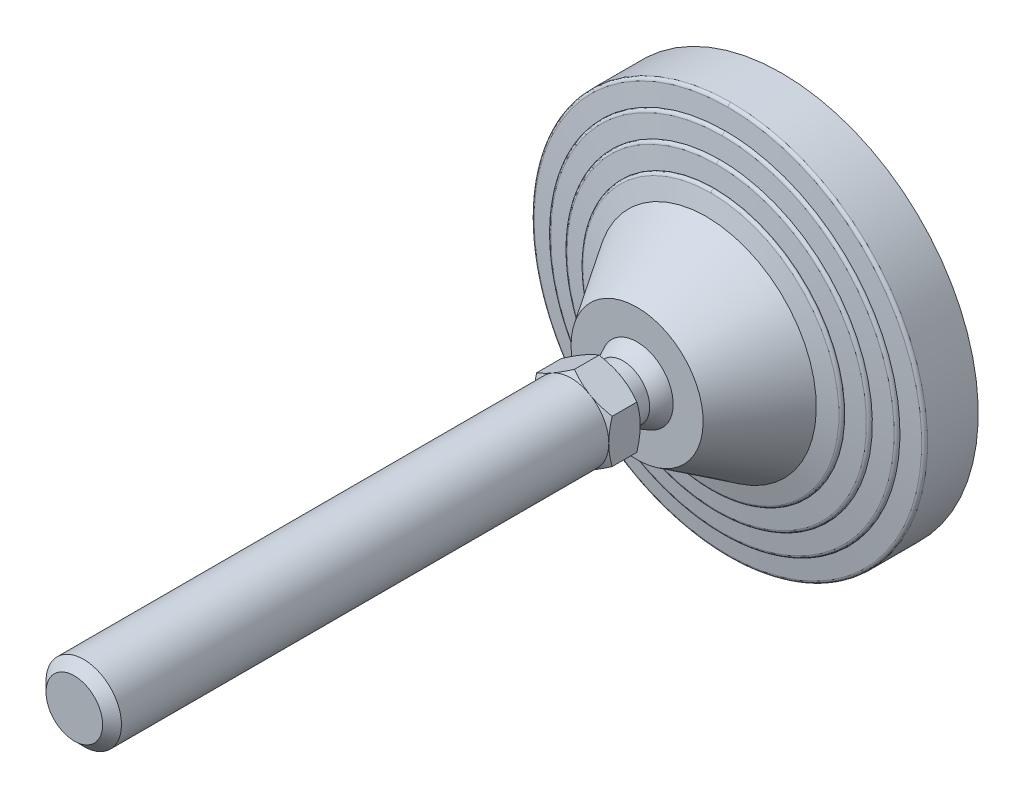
ISO-10303-21;
HEADER;
FILE_DESCRIPTION(('STEP AP214'),'2;1');
FILE_NAME('part.step','',(''),(''),'','','');
FILE_SCHEMA(('AUTOMOTIVE_DESIGN { 1 0 10303 214 1 1 1 1 }'));
ENDSEC;
DATA;
#1=APPLICATION_CONTEXT('core data for automotive mechanical design processes');
#2=APPLICATION_PROTOCOL_DEFINITION('international standard','automotive_design',2000,#1);
#3=PRODUCT_CONTEXT('',#1,'mechanical');
#4=PRODUCT('Part','Part','',(#3));
#5=PRODUCT_RELATED_PRODUCT_CATEGORY('part','',(#4));
#6=PRODUCT_DEFINITION_FORMATION('','',#4);
#7=PRODUCT_DEFINITION_CONTEXT('part definition',#1,'design');
#8=PRODUCT_DEFINITION('design','',#6,#7);
#9=PRODUCT_DEFINITION_SHAPE('','',#8);
#10=(LENGTH_UNIT() NAMED_UNIT(*) SI_UNIT(.MILLI.,.METRE.));
#11=(NAMED_UNIT(*) PLANE_ANGLE_UNIT() SI_UNIT($,.RADIAN.));
#12=(NAMED_UNIT(*) SI_UNIT($,.STERADIAN.) SOLID_ANGLE_UNIT());
#13=UNCERTAINTY_MEASURE_WITH_UNIT(LENGTH_MEASURE(1.E-05),#10,'distance_accuracy_value','');
#14=(GEOMETRIC_REPRESENTATION_CONTEXT(3) GLOBAL_UNCERTAINTY_ASSIGNED_CONTEXT((#13)) GLOBAL_UNIT_ASSIGNED_CONTEXT((#10,
#11,#12)) REPRESENTATION_CONTEXT('',''));
#15=CARTESIAN_POINT('',(0.,0.,0.));
#16=DIRECTION('',(0.,0.,1.));
#17=DIRECTION('',(1.,0.,0.));
#18=AXIS2_PLACEMENT_3D('',#15,#16,#17);
#19=CARTESIAN_POINT('',(-63.467641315,63.25,0.));
#20=DIRECTION('',(0.,0.,1.));
#21=DIRECTION('',(0.,-1.,0.));
#22=AXIS2_PLACEMENT_3D('',#19,#20,#21);
#23=PLANE('',#22);
#24=CARTESIAN_POINT('',(0.,0.,0.));
#25=DIRECTION('',(0.,0.,-1.));
#26=DIRECTION('',(0.,1.,0.));
#27=AXIS2_PLACEMENT_3D('',#24,#25,#26);
#28=CIRCLE('',#27,62.5);
#29=CARTESIAN_POINT('',(0.,62.5,0.));
#30=VERTEX_POINT('',#29);
#31=EDGE_CURVE('E419',#30,#30,#28,.F.);
#32=ORIENTED_EDGE('',*,*,#31,.F.);
#33=EDGE_LOOP('',(#32));
#34=FACE_BOUND('',#33,.T.);
#35=ADVANCED_FACE('F14',(#34),#23,.F.);
#36=CARTESIAN_POINT('',(0.,0.,16.119206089));
#37=DIRECTION('',(0.,0.,-1.));
#38=DIRECTION('',(0.,1.,0.));
#39=AXIS2_PLACEMENT_3D('',#36,#37,#38);
#40=CYLINDRICAL_SURFACE('',#39,62.5);
#41=ORIENTED_EDGE('',*,*,#31,.T.);
#42=EDGE_LOOP('',(#41));
#43=FACE_BOUND('',#42,.T.);
#44=CARTESIAN_POINT('',(0.,0.,16.119206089));
#45=DIRECTION('',(0.,0.,1.));
#46=DIRECTION('',(0.,-1.,0.));
#47=AXIS2_PLACEMENT_3D('',#44,#45,#46);
#48=CIRCLE('',#47,62.5);
#49=CARTESIAN_POINT('',(-6.40950078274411E-09,-62.5,16.119206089));
#50=VERTEX_POINT('',#49);
#51=CARTESIAN_POINT('',(0.,62.5,16.119206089));
#52=VERTEX_POINT('',#51);
#53=EDGE_CURVE('E572',#50,#52,#48,.T.);
#54=ORIENTED_EDGE('',*,*,#53,.F.);
#55=CARTESIAN_POINT('',(0.,0.,16.119206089));
#56=DIRECTION('',(0.,0.,1.));
#57=DIRECTION('',(0.,-1.,0.));
#58=AXIS2_PLACEMENT_3D('',#55,#56,#57);
#59=CIRCLE('',#58,62.5);
#60=EDGE_CURVE('E422',#52,#50,#59,.T.);
#61=ORIENTED_EDGE('',*,*,#60,.F.);
#62=EDGE_LOOP('',(#54,#61));
#63=FACE_BOUND('',#62,.T.);
#64=ADVANCED_FACE('F285',(#43,#63),#40,.T.);
#65=CARTESIAN_POINT('',(0.,-62.5,16.119206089));
#66=CARTESIAN_POINT('',(-125.,-62.5,16.1192060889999));
#67=CARTESIAN_POINT('',(-125.,62.5,16.1192060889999));
#68=CARTESIAN_POINT('',(0.,62.5,16.119206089));
#69=CARTESIAN_POINT('',(0.,-62.5,16.647800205));
#70=CARTESIAN_POINT('',(-125.,-62.5,16.6478002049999));
#71=CARTESIAN_POINT('',(-125.,62.5,16.6478002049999));
#72=CARTESIAN_POINT('',(0.,62.5,16.647800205));
#73=CARTESIAN_POINT('',(0.,-62.150618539,17.044466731));
#74=CARTESIAN_POINT('',(-124.301237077,-62.150618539,17.0444667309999));
#75=CARTESIAN_POINT('',(-124.301237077,62.150618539,17.0444667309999));
#76=CARTESIAN_POINT('',(0.,62.150618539,17.044466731));
#77=CARTESIAN_POINT('',(0.,-61.62625428,17.111204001));
#78=CARTESIAN_POINT('',(-123.252508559,-61.6262542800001,17.1112040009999));
#79=CARTESIAN_POINT('',(-123.252508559,61.6262542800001,17.1112040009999));
#80=CARTESIAN_POINT('',(0.,61.62625428,17.111204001));
#81=(BOUNDED_SURFACE() B_SPLINE_SURFACE(3,3,((#65,#66,#67,#68),(#69,#70,#71,#72),(#73,#74,#75,
#76),(#77,#78,#79,#80)),.UNSPECIFIED.,.F.,.F.,.F.) B_SPLINE_SURFACE_WITH_KNOTS((4,4),(4,4),(0.,
1.),(0.,1.),.UNSPECIFIED.) GEOMETRIC_REPRESENTATION_ITEM() RATIONAL_B_SPLINE_SURFACE(((1.,
0.333333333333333,0.333333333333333,1.),(0.833611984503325,0.277870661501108,0.277870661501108,
0.833611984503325),(0.833611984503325,0.277870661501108,0.277870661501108,0.833611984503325),
(1.,0.333333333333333,0.333333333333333,1.))) REPRESENTATION_ITEM('') SURFACE());
#82=CARTESIAN_POINT('',(0.,62.5,16.119206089));
#83=CARTESIAN_POINT('',(0.,62.5,16.647800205));
#84=CARTESIAN_POINT('',(0.,62.150618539,17.044466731));
#85=CARTESIAN_POINT('',(0.,61.62625428,17.111204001));
#86=(BOUNDED_CURVE() B_SPLINE_CURVE(3,(#82,#83,#84,#85),.UNSPECIFIED.,.F.,
.F.) B_SPLINE_CURVE_WITH_KNOTS((4,4),(0.,1.),
.UNSPECIFIED.) CURVE() GEOMETRIC_REPRESENTATION_ITEM() RATIONAL_B_SPLINE_CURVE((1.,
0.833611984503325,0.833611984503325,1.)) REPRESENTATION_ITEM(''));
#87=CARTESIAN_POINT('',(0.,61.6262542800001,17.111204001));
#88=VERTEX_POINT('',#87);
#89=EDGE_CURVE('E563',#52,#88,#86,.T.);
#90=CARTESIAN_POINT('',(0.,-62.5,16.119206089));
#91=CARTESIAN_POINT('',(0.,-62.5,16.647800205));
#92=CARTESIAN_POINT('',(0.,-62.150618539,17.044466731));
#93=CARTESIAN_POINT('',(0.,-61.62625428,17.111204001));
#94=(BOUNDED_CURVE() B_SPLINE_CURVE(3,(#90,#91,#92,#93),.UNSPECIFIED.,.F.,
.F.) B_SPLINE_CURVE_WITH_KNOTS((4,4),(0.,1.),
.UNSPECIFIED.) CURVE() GEOMETRIC_REPRESENTATION_ITEM() RATIONAL_B_SPLINE_CURVE((1.,
0.833611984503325,0.833611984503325,1.)) REPRESENTATION_ITEM(''));
#95=CARTESIAN_POINT('',(-1.89596538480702E-08,-61.6262542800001,17.111204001));
#96=VERTEX_POINT('',#95);
#97=EDGE_CURVE('E577',#96,#50,#94,.F.);
#98=CARTESIAN_POINT('',(0.,0.,17.111204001));
#99=DIRECTION('',(0.,0.,-1.));
#100=DIRECTION('',(0.,1.,0.));
#101=AXIS2_PLACEMENT_3D('',#98,#99,#100);
#102=CIRCLE('',#101,61.62625428);
#103=EDGE_CURVE('E556',#88,#96,#102,.F.);
#104=ORIENTED_EDGE('',*,*,#89,.F.);
#105=ORIENTED_EDGE('',*,*,#60,.T.);
#106=ORIENTED_EDGE('',*,*,#97,.F.);
#107=ORIENTED_EDGE('',*,*,#103,.F.);
#108=EDGE_LOOP('',(#104,#105,#106,#107));
#109=FACE_BOUND('',#108,.T.);
#110=ADVANCED_FACE('F923',(#109),#81,.T.);
#111=CARTESIAN_POINT('',(0.,62.5,16.119206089));
#112=CARTESIAN_POINT('',(125.,62.5,16.1192060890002));
#113=CARTESIAN_POINT('',(125.,-62.5,16.1192060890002));
#114=CARTESIAN_POINT('',(0.,-62.5,16.119206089));
#115=CARTESIAN_POINT('',(0.,62.5,16.647800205));
#116=CARTESIAN_POINT('',(125.,62.5,16.6478002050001));
#117=CARTESIAN_POINT('',(125.,-62.5,16.6478002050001));
#118=CARTESIAN_POINT('',(0.,-62.5,16.647800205));
#119=CARTESIAN_POINT('',(0.,62.150618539,17.044466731));
#120=CARTESIAN_POINT('',(124.301237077,62.150618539,17.0444667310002));
#121=CARTESIAN_POINT('',(124.301237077,-62.150618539,17.0444667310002));
#122=CARTESIAN_POINT('',(0.,-62.150618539,17.044466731));
#123=CARTESIAN_POINT('',(0.,61.62625428,17.111204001));
#124=CARTESIAN_POINT('',(123.252508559,61.6262542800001,17.1112040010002));
#125=CARTESIAN_POINT('',(123.252508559,-61.6262542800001,17.1112040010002));
#126=CARTESIAN_POINT('',(0.,-61.62625428,17.111204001));
#127=(BOUNDED_SURFACE() B_SPLINE_SURFACE(3,3,((#111,#112,#113,#114),(#115,#116,#117,#118),(#119,
#120,#121,#122),(#123,#124,#125,#126)),.UNSPECIFIED.,.F.,.F.,
.F.) B_SPLINE_SURFACE_WITH_KNOTS((4,4),(4,4),(0.,1.),(0.,1.),
.UNSPECIFIED.) GEOMETRIC_REPRESENTATION_ITEM() RATIONAL_B_SPLINE_SURFACE(((1.,0.333333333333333,
0.333333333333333,1.),(0.833611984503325,0.277870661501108,0.277870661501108,0.833611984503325),
(0.833611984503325,0.277870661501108,0.277870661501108,0.833611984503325),(1.,0.333333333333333,
0.333333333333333,1.))) REPRESENTATION_ITEM('') SURFACE());
#128=CARTESIAN_POINT('',(0.,0.,17.111204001));
#129=DIRECTION('',(0.,0.,-1.));
#130=DIRECTION('',(0.,1.,0.));
#131=AXIS2_PLACEMENT_3D('',#128,#129,#130);
#132=CIRCLE('',#131,61.62625428);
#133=EDGE_CURVE('E562',#96,#88,#132,.F.);
#134=ORIENTED_EDGE('',*,*,#53,.T.);
#135=ORIENTED_EDGE('',*,*,#89,.T.);
#136=ORIENTED_EDGE('',*,*,#133,.F.);
#137=ORIENTED_EDGE('',*,*,#97,.T.);
#138=EDGE_LOOP('',(#134,#135,#136,#137));
#139=FACE_BOUND('',#138,.T.);
#140=ADVANCED_FACE('F404',(#139),#127,.T.);
#141=CARTESIAN_POINT('',(0.,0.,17.890909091));
#142=DIRECTION('',(0.,0.,-1.));
#143=DIRECTION('',(0.,1.,0.));
#144=AXIS2_PLACEMENT_3D('',#141,#142,#143);
#145=CONICAL_SURFACE('',#144,55.5,1.44420419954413);
#146=ORIENTED_EDGE('',*,*,#103,.T.);
#147=ORIENTED_EDGE('',*,*,#133,.T.);
#148=EDGE_LOOP('',(#146,#147));
#149=FACE_BOUND('',#148,.T.);
#150=CARTESIAN_POINT('',(-1.13831164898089E-08,-55.5,17.890909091));
#151=CARTESIAN_POINT('',(0.666810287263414,-55.5000058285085,17.890909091));
#152=CARTESIAN_POINT('',(1.33362158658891,-55.4879831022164,17.890909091));
#153=CARTESIAN_POINT('',(2.66828219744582,-55.4398527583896,17.890909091));
#154=CARTESIAN_POINT('',(3.33612903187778,-55.4036764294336,17.890909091));
#155=CARTESIAN_POINT('',(4.67008368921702,-55.3072108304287,17.890909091));
#156=CARTESIAN_POINT('',(5.33619149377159,-55.2469213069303,17.890909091));
#157=CARTESIAN_POINT('',(6.66630694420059,-55.1022519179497,17.890909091));
#158=CARTESIAN_POINT('',(7.33031261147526,-55.0178537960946,17.890909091));
#159=CARTESIAN_POINT('',(8.65488946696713,-54.8250946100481,17.890909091));
#160=CARTESIAN_POINT('',(9.31546019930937,-54.7167304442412,17.890909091));
#161=CARTESIAN_POINT('',(11.303244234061,-54.3535835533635,17.890909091));
#162=CARTESIAN_POINT('',(12.6239565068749,-54.0621103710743,17.890909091));
#163=CARTESIAN_POINT('',(15.240792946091,-53.3834839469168,17.890909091));
#164=CARTESIAN_POINT('',(16.5369104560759,-52.9963051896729,17.890909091));
#165=CARTESIAN_POINT('',(19.0989356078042,-52.1278427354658,17.890909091));
#166=CARTESIAN_POINT('',(20.3648068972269,-51.6464516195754,17.890909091));
#167=CARTESIAN_POINT('',(22.8579438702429,-50.5924539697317,17.890909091));
#168=CARTESIAN_POINT('',(24.0852091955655,-50.0198465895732,17.890909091));
#169=CARTESIAN_POINT('',(26.678667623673,-48.692216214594,17.8909090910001));
#170=CARTESIAN_POINT('',(28.0374663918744,-47.9226902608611,17.890909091));
#171=CARTESIAN_POINT('',(30.685519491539,-46.271847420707,17.890909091));
#172=CARTESIAN_POINT('',(31.9747656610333,-45.3905174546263,17.890909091));
#173=CARTESIAN_POINT('',(34.4745529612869,-43.5222940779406,17.890909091));
#174=CARTESIAN_POINT('',(35.6850872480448,-42.5353915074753,17.890909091));
#175=CARTESIAN_POINT('',(38.0186685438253,-40.4631409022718,17.890909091));
#176=CARTESIAN_POINT('',(39.1417181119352,-39.3777957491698,17.8909090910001));
#177=CARTESIAN_POINT('',(41.2923479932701,-37.1163936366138,17.8909090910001));
#178=CARTESIAN_POINT('',(42.3199319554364,-35.9403401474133,17.890909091));
#179=CARTESIAN_POINT('',(44.2723789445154,-33.5058382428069,17.890909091));
#180=CARTESIAN_POINT('',(45.1972412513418,-32.2473892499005,17.890909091));
#181=CARTESIAN_POINT('',(46.9376312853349,-29.6570957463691,17.8909090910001));
#182=CARTESIAN_POINT('',(47.7531628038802,-28.3252537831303,17.8909090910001));
#183=CARTESIAN_POINT('',(49.2691299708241,-25.5976050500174,17.8909090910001));
#184=CARTESIAN_POINT('',(49.9695658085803,-24.201798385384,17.8909090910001));
#185=CARTESIAN_POINT('',(51.2503706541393,-21.3561258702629,17.8909090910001));
#186=CARTESIAN_POINT('',(51.8307383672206,-19.9062594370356,17.8909090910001));
#187=CARTESIAN_POINT('',(52.8672716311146,-16.9627885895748,17.8909090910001));
#188=CARTESIAN_POINT('',(53.3234371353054,-15.4691841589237,17.8909090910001));
#189=CARTESIAN_POINT('',(54.1083272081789,-12.4488388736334,17.8909090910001));
#190=CARTESIAN_POINT('',(54.4370503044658,-10.922097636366,17.8909090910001));
#191=CARTESIAN_POINT('',(54.9647110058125,-7.84634988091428,17.8909090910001));
#192=CARTESIAN_POINT('',(55.1636486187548,-6.29734336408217,17.8909090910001));
#193=CARTESIAN_POINT('',(55.43032456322,-3.18807153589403,17.8909090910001));
#194=CARTESIAN_POINT('',(55.4980623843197,-1.62780618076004,17.8909090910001));
#195=CARTESIAN_POINT('',(55.5018556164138,1.49288460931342,17.8909090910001));
#196=CARTESIAN_POINT('',(55.4379110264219,3.05331004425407,17.8909090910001));
#197=CARTESIAN_POINT('',(55.1787965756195,6.16319684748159,17.8909090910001));
#198=CARTESIAN_POINT('',(54.98362926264,7.71265842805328,17.8909090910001));
#199=CARTESIAN_POINT('',(54.4634594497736,10.7896325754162,17.8909090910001));
#200=CARTESIAN_POINT('',(54.1384569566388,12.3171451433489,17.8909090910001));
#201=CARTESIAN_POINT('',(53.3609336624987,15.3393372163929,17.8909090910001));
#202=CARTESIAN_POINT('',(52.9084149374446,16.8340172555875,17.8909090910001));
#203=CARTESIAN_POINT('',(51.879073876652,19.7799443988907,17.8909090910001));
#204=CARTESIAN_POINT('',(51.3022515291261,21.2311914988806,17.8909090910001));
#205=CARTESIAN_POINT('',(50.0283709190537,24.0800097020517,17.8909090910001));
#206=CARTESIAN_POINT('',(49.3313064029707,25.47757800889,17.890909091));
#207=CARTESIAN_POINT('',(47.8219174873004,28.2090226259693,17.890909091));
#208=CARTESIAN_POINT('',(47.0095931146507,29.5428989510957,17.8909090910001));
#209=CARTESIAN_POINT('',(45.2754391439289,32.1375097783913,17.8909090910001));
#210=CARTESIAN_POINT('',(44.3536065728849,33.3982422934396,17.8909090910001));
#211=CARTESIAN_POINT('',(42.4069961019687,35.8375708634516,17.890909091));
#212=CARTESIAN_POINT('',(41.3822180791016,37.0161668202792,17.890909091));
#213=CARTESIAN_POINT('',(39.2371577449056,39.2826945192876,17.890909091));
#214=CARTESIAN_POINT('',(38.1168855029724,40.3706357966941,17.890909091));
#215=CARTESIAN_POINT('',(35.7885615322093,42.4483529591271,17.890909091));
#216=CARTESIAN_POINT('',(34.5805102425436,43.4381293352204,17.8909090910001));
#217=CARTESIAN_POINT('',(32.5014047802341,44.999906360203,17.890909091));
#218=CARTESIAN_POINT('',(31.6521856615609,45.6012216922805,17.890909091));
#219=CARTESIAN_POINT('',(29.9212415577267,46.7552239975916,17.890909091));
#220=CARTESIAN_POINT('',(29.0395163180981,47.3079105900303,17.890909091));
#221=CARTESIAN_POINT('',(27.2463975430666,48.3628576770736,17.890909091));
#222=CARTESIAN_POINT('',(26.3350034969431,48.8651173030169,17.890909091));
#223=CARTESIAN_POINT('',(24.4853750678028,49.817652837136,17.890909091));
#224=CARTESIAN_POINT('',(23.5471392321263,50.2679259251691,17.890909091));
#225=CARTESIAN_POINT('',(21.6468644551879,51.1150215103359,17.890909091));
#226=CARTESIAN_POINT('',(20.6848259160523,51.5118449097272,17.890909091));
#227=CARTESIAN_POINT('',(18.7400290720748,52.2507726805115,17.890909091));
#228=CARTESIAN_POINT('',(17.7572723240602,52.5928811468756,17.890909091));
#229=CARTESIAN_POINT('',(15.8636176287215,53.1929617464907,17.890909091));
#230=CARTESIAN_POINT('',(14.954239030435,53.4557406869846,17.890909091));
#231=CARTESIAN_POINT('',(13.1232854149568,53.93444797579,17.890909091));
#232=CARTESIAN_POINT('',(12.201711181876,54.1503793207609,17.890909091));
#233=CARTESIAN_POINT('',(10.3487557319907,54.5348378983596,17.890909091));
#234=CARTESIAN_POINT('',(9.41737477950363,54.7033664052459,17.890909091));
#235=CARTESIAN_POINT('',(7.54728204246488,54.9925789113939,17.890909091));
#236=CARTESIAN_POINT('',(6.60857079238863,55.1132663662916,17.890909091));
#237=CARTESIAN_POINT('',(4.72616569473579,55.3064952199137,17.890909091));
#238=CARTESIAN_POINT('',(3.78247163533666,55.3790345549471,17.890909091));
#239=CARTESIAN_POINT('',(1.89251924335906,55.4758006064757,17.890909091));
#240=CARTESIAN_POINT('',(0.946260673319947,55.5000226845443,17.890909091));
#241=CARTESIAN_POINT('',(-1.661183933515E-09,55.5,17.890909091));
#242=B_SPLINE_CURVE_WITH_KNOTS('',3,(#150,#151,#152,#153,#154,#155,#156,#157,#158,#159,#160,
#161,#162,#163,#164,#165,#166,#167,#168,#169,#170,#171,#172,#173,#174,#175,#176,#177,#178,#179,
#180,#181,#182,#183,#184,#185,#186,#187,#188,#189,#190,#191,#192,#193,#194,#195,#196,#197,#198,
#199,#200,#201,#202,#203,#204,#205,#206,#207,#208,#209,#210,#211,#212,#213,#214,#215,#216,#217,
#218,#219,#220,#221,#222,#223,#224,#225,#226,#227,#228,#229,#230,#231,#232,#233,#234,#235,#236,
#237,#238,#239,#240,#241),.UNSPECIFIED.,.F.,.F.,(4,2,2,2,2,2,2,2,2,2,2,2,2,2,2,2,2,2,2,2,2,2,2,
2,2,2,2,2,2,2,2,2,2,2,2,2,2,2,2,2,2,2,2,2,2,4),(0.,2.00032482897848,4.00636450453,
6.01242526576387,8.02000917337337,10.0278530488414,14.0813911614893,18.136011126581,
22.1952813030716,26.2545891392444,30.9336173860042,35.6131935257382,40.2931760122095,
44.9730215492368,49.65268813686,54.3323875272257,59.0119245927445,63.6914539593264,
68.3710337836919,73.0506153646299,77.7302510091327,82.4098863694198,87.0895399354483,
91.7691935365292,96.4487562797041,101.128318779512,105.807805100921,110.487291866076,
115.167022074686,119.846751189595,124.526607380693,129.206469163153,133.885838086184,
138.565183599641,141.685351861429,144.805544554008,147.925790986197,151.046206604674,
154.166569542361,157.286698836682,160.125236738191,162.963593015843,165.801872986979,
168.639947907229,171.478144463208,174.316613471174),.UNSPECIFIED.);
#243=CARTESIAN_POINT('',(-1.13832527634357E-08,-55.5,17.895966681));
#244=VERTEX_POINT('',#243);
#245=CARTESIAN_POINT('',(-1.66120282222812E-09,55.5,17.895966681));
#246=VERTEX_POINT('',#245);
#247=EDGE_CURVE('E385',#244,#246,#242,.T.);
#248=ORIENTED_EDGE('',*,*,#247,.F.);
#249=CARTESIAN_POINT('',(-1.66120055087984E-09,55.5,17.890909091));
#250=CARTESIAN_POINT('',(-0.6668103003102,55.5000058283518,17.890909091));
#251=CARTESIAN_POINT('',(-1.33362159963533,55.4879831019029,17.890909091));
#252=CARTESIAN_POINT('',(-2.66828221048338,55.4398527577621,17.890909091));
#253=CARTESIAN_POINT('',(-3.33612904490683,55.403676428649,17.890909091));
#254=CARTESIAN_POINT('',(-4.67008370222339,55.3072108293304,17.890909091));
#255=CARTESIAN_POINT('',(-5.33619150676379,55.2469213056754,17.890909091));
#256=CARTESIAN_POINT('',(-6.66630695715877,55.102251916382,17.890909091));
#257=CARTESIAN_POINT('',(-7.33031262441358,55.0178537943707,17.890909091));
#258=CARTESIAN_POINT('',(-8.65488947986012,54.8250946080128,17.890909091));
#259=CARTESIAN_POINT('',(-9.31546021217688,54.7167304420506,17.890909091));
#260=CARTESIAN_POINT('',(-11.3032442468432,54.3535835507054,17.890909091));
#261=CARTESIAN_POINT('',(-12.6239565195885,54.0621103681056,17.890909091));
#262=CARTESIAN_POINT('',(-15.240792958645,53.3834839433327,17.890909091));
#263=CARTESIAN_POINT('',(-16.5369104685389,52.996305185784,17.890909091));
#264=CARTESIAN_POINT('',(-19.0989356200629,52.1278427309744,17.890909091));
#265=CARTESIAN_POINT('',(-20.3648069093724,51.6464516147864,17.890909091));
#266=CARTESIAN_POINT('',(-22.8579438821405,50.5924539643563,17.890909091));
#267=CARTESIAN_POINT('',(-24.0852092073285,50.0198465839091,17.890909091));
#268=CARTESIAN_POINT('',(-26.6786676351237,48.6922162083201,17.8909090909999));
#269=CARTESIAN_POINT('',(-28.0374664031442,47.9226902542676,17.890909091));
#270=CARTESIAN_POINT('',(-30.6855195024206,46.2718474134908,17.890909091));
#271=CARTESIAN_POINT('',(-31.9747656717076,45.3905174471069,17.890909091));
#272=CARTESIAN_POINT('',(-34.4745529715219,43.5222940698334,17.890909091));
#273=CARTESIAN_POINT('',(-35.6850872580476,42.5353914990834,17.890909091));
#274=CARTESIAN_POINT('',(-38.0186685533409,40.4631408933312,17.890909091));
#275=CARTESIAN_POINT('',(-39.1417181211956,39.377795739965,17.890909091));
#276=CARTESIAN_POINT('',(-41.2923480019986,37.1163936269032,17.890909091));
#277=CARTESIAN_POINT('',(-42.3199319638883,35.9403401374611,17.890909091));
#278=CARTESIAN_POINT('',(-44.2723789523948,33.5058382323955,17.890909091));
#279=CARTESIAN_POINT('',(-45.1972412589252,32.2473892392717,17.8909090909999));
#280=CARTESIAN_POINT('',(-46.9376312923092,29.657095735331,17.8909090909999));
#281=CARTESIAN_POINT('',(-47.7531628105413,28.3252537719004,17.8909090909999));
#282=CARTESIAN_POINT('',(-49.2691299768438,25.597605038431,17.8909090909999));
#283=CARTESIAN_POINT('',(-49.9695658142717,24.2017983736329,17.890909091));
#284=CARTESIAN_POINT('',(-51.2503706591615,21.3561258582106,17.890909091));
#285=CARTESIAN_POINT('',(-51.8307383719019,19.9062594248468,17.8909090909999));
#286=CARTESIAN_POINT('',(-52.8672716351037,16.9627885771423,17.8909090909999));
#287=CARTESIAN_POINT('',(-53.3234371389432,15.4691841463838,17.8909090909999));
#288=CARTESIAN_POINT('',(-54.1083272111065,12.448838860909,17.8909090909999));
#289=CARTESIAN_POINT('',(-54.4370503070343,10.9220976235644,17.8909090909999));
#290=CARTESIAN_POINT('',(-54.9647110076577,7.84634986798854,17.8909090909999));
#291=CARTESIAN_POINT('',(-55.1636486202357,6.29734335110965,17.890909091));
#292=CARTESIAN_POINT('',(-55.4303245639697,3.18807152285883,17.890909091));
#293=CARTESIAN_POINT('',(-55.4980623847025,1.62780616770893,17.8909090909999));
#294=CARTESIAN_POINT('',(-55.5018556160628,-1.49288462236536,17.8909090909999));
#295=CARTESIAN_POINT('',(-55.4379110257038,-3.05331005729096,17.8909090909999));
#296=CARTESIAN_POINT('',(-55.1787965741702,-6.16319686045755,17.8909090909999));
#297=CARTESIAN_POINT('',(-54.9836292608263,-7.71265844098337,17.8909090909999));
#298=CARTESIAN_POINT('',(-54.4634594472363,-10.789632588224,17.8909090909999));
#299=CARTESIAN_POINT('',(-54.1384569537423,-12.3171451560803,17.890909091));
#300=CARTESIAN_POINT('',(-53.3609336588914,-15.3393372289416,17.890909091));
#301=CARTESIAN_POINT('',(-52.9084149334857,-16.8340172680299,17.8909090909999));
#302=CARTESIAN_POINT('',(-51.8790738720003,-19.7799444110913,17.8909090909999));
#303=CARTESIAN_POINT('',(-51.302251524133,-21.2311915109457,17.8909090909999));
#304=CARTESIAN_POINT('',(-50.0283709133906,-24.0800097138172,17.8909090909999));
#305=CARTESIAN_POINT('',(-49.331306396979,-25.4775780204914,17.8909090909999));
#306=CARTESIAN_POINT('',(-47.8219174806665,-28.2090226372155,17.8909090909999));
#307=CARTESIAN_POINT('',(-47.0095931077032,-29.5428989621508,17.890909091));
#308=CARTESIAN_POINT('',(-45.2754391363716,-32.137509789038,17.890909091));
#309=CARTESIAN_POINT('',(-44.3536065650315,-33.3982423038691,17.890909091));
#310=CARTESIAN_POINT('',(-42.4069960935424,-35.8375708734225,17.890909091));
#311=CARTESIAN_POINT('',(-41.3822180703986,-37.0161668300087,17.890909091));
#312=CARTESIAN_POINT('',(-39.2371577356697,-39.2826945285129,17.890909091));
#313=CARTESIAN_POINT('',(-38.1168854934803,-40.3706358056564,17.890909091));
#314=CARTESIAN_POINT('',(-35.7885615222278,-42.4483529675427,17.890909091));
#315=CARTESIAN_POINT('',(-34.5805102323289,-43.4381293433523,17.8909090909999));
#316=CARTESIAN_POINT('',(-32.5014047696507,-44.999906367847,17.890909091));
#317=CARTESIAN_POINT('',(-31.6521856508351,-45.6012216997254,17.890909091));
#318=CARTESIAN_POINT('',(-29.9212415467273,-46.7552240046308,17.890909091));
#319=CARTESIAN_POINT('',(-29.0395163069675,-47.3079105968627,17.890909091));
#320=CARTESIAN_POINT('',(-27.2463975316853,-48.3628576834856,17.890909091));
#321=CARTESIAN_POINT('',(-26.3350034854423,-48.8651173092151,17.890909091));
#322=CARTESIAN_POINT('',(-24.4853750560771,-49.8176528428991,17.890909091));
#323=CARTESIAN_POINT('',(-23.5471392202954,-50.2679259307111,17.890909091));
#324=CARTESIAN_POINT('',(-21.6468644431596,-51.1150215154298,17.890909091));
#325=CARTESIAN_POINT('',(-20.6848259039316,-51.5118449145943,17.890909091));
#326=CARTESIAN_POINT('',(-18.7400290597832,-52.2507726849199,17.890909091));
#327=CARTESIAN_POINT('',(-17.75727231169,-52.5928811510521,17.890909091));
#328=CARTESIAN_POINT('',(-15.8636176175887,-53.192961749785,17.890909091));
#329=CARTESIAN_POINT('',(-14.9542390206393,-53.4557406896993,17.890909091));
#330=CARTESIAN_POINT('',(-13.1232854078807,-53.9344479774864,17.890909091));
#331=CARTESIAN_POINT('',(-12.2017111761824,-54.1503793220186,17.890909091));
#332=CARTESIAN_POINT('',(-10.3487557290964,-54.5348378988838,17.890909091));
#333=CARTESIAN_POINT('',(-9.41737477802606,-54.7033664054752,17.890909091));
#334=CARTESIAN_POINT('',(-7.54728204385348,-54.9925789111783,17.890909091));
#335=CARTESIAN_POINT('',(-6.60857079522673,-55.1132663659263,17.890909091));
#336=CARTESIAN_POINT('',(-4.72616570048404,-55.3064952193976,17.890909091));
#337=CARTESIAN_POINT('',(-3.78247164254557,-55.3790345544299,17.890909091));
#338=CARTESIAN_POINT('',(-1.89251925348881,-55.4758006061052,17.890909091));
#339=CARTESIAN_POINT('',(-0.946260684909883,-55.5000226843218,17.890909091));
#340=CARTESIAN_POINT('',(-1.13832526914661E-08,-55.5,17.890909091));
#341=B_SPLINE_CURVE_WITH_KNOTS('',3,(#249,#250,#251,#252,#253,#254,#255,#256,#257,#258,#259,
#260,#261,#262,#263,#264,#265,#266,#267,#268,#269,#270,#271,#272,#273,#274,#275,#276,#277,#278,
#279,#280,#281,#282,#283,#284,#285,#286,#287,#288,#289,#290,#291,#292,#293,#294,#295,#296,#297,
#298,#299,#300,#301,#302,#303,#304,#305,#306,#307,#308,#309,#310,#311,#312,#313,#314,#315,#316,
#317,#318,#319,#320,#321,#322,#323,#324,#325,#326,#327,#328,#329,#330,#331,#332,#333,#334,#335,
#336,#337,#338,#339,#340),.UNSPECIFIED.,.F.,.F.,(4,2,2,2,2,2,2,2,2,2,2,2,2,2,2,2,2,2,2,2,2,2,2,
2,2,2,2,2,2,2,2,2,2,2,2,2,2,2,2,2,2,2,2,2,2,4),(0.,2.00032482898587,4.00636450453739,
6.01242526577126,8.02000917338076,10.0278530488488,14.0813911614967,18.1360111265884,
22.195281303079,26.2545891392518,30.9336173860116,35.6131935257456,40.2931760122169,
44.9730215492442,49.6526881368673,54.332387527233,59.0119245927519,63.6914539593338,
68.3710337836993,73.0506153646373,77.73025100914,82.4098863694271,87.0895399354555,
91.7691935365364,96.4487562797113,101.12831877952,105.807805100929,110.487291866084,
115.167022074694,119.846751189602,124.526607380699,129.206469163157,133.88583808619,
138.565183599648,141.68535186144,144.805544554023,147.925790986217,151.046206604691,
154.166569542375,157.28669883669,160.125236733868,162.963593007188,165.801872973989,
168.639947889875,171.47814444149,174.316613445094),.UNSPECIFIED.);
#342=EDGE_CURVE('E397',#246,#244,#341,.T.);
#343=ORIENTED_EDGE('',*,*,#342,.F.);
#344=EDGE_LOOP('',(#248,#343));
#345=FACE_BOUND('',#344,.T.);
#346=ADVANCED_FACE('F399',(#149,#345),#145,.T.);
#347=CARTESIAN_POINT('',(0.,-55.5,17.887804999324));
#348=CARTESIAN_POINT('',(-111.,-55.5000000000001,17.8878049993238));
#349=CARTESIAN_POINT('',(-111.,55.5000000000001,17.8878049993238));
#350=CARTESIAN_POINT('',(0.,55.5,17.887804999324));
#351=CARTESIAN_POINT('',(0.,-55.5,17.892211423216));
#352=CARTESIAN_POINT('',(-111.,-55.5000000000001,17.8922114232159));
#353=CARTESIAN_POINT('',(-111.,55.5000000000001,17.8922114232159));
#354=CARTESIAN_POINT('',(0.,55.5,17.892211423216));
#355=CARTESIAN_POINT('',(0.,-55.5,17.896617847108));
#356=CARTESIAN_POINT('',(-111.,-55.5000000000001,17.8966178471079));
#357=CARTESIAN_POINT('',(-111.,55.5000000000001,17.8966178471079));
#358=CARTESIAN_POINT('',(0.,55.5,17.896617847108));
#359=CARTESIAN_POINT('',(0.,-55.5,17.901024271));
#360=CARTESIAN_POINT('',(-111.,-55.5000000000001,17.9010242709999));
#361=CARTESIAN_POINT('',(-111.,55.5000000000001,17.9010242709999));
#362=CARTESIAN_POINT('',(0.,55.5,17.901024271));
#363=CARTESIAN_POINT('',(0.,-55.5,18.429618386));
#364=CARTESIAN_POINT('',(-111.,-55.5,18.4296183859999));
#365=CARTESIAN_POINT('',(-111.,55.5,18.4296183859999));
#366=CARTESIAN_POINT('',(0.,55.5,18.429618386));
#367=CARTESIAN_POINT('',(0.,-55.150618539,18.826284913));
#368=CARTESIAN_POINT('',(-110.301237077,-55.150618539,18.8262849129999));
#369=CARTESIAN_POINT('',(-110.301237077,55.150618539,18.8262849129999));
#370=CARTESIAN_POINT('',(0.,55.150618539,18.826284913));
#371=CARTESIAN_POINT('',(0.,-54.62625428,18.893022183));
#372=CARTESIAN_POINT('',(-109.252508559,-54.62625428,18.8930221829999));
#373=CARTESIAN_POINT('',(-109.252508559,54.62625428,18.8930221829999));
#374=CARTESIAN_POINT('',(0.,54.62625428,18.893022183));
#375=(BOUNDED_SURFACE() B_SPLINE_SURFACE(3,3,((#347,#348,#349,#350),(#351,#352,#353,#354),(#355,
#356,#357,#358),(#359,#360,#361,#362),(#363,#364,#365,#366),(#367,#368,#369,#370),(#371,#372,
#373,#374)),.UNSPECIFIED.,.F.,.F.,.F.) B_SPLINE_SURFACE_WITH_KNOTS((4,3,4),(4,4),(-0.01,0.,1.),
(0.,1.),.UNSPECIFIED.) GEOMETRIC_REPRESENTATION_ITEM() RATIONAL_B_SPLINE_SURFACE(((1.,
0.333333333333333,0.333333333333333,1.),(1.,0.333333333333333,0.333333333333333,1.),(1.,
0.333333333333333,0.333333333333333,1.),(1.,0.333333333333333,0.333333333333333,1.),
(0.833611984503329,0.27787066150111,0.27787066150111,0.833611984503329),(0.833611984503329,
0.27787066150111,0.27787066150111,0.833611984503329),(1.,0.333333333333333,0.333333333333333,1.))) REPRESENTATION_ITEM('') SURFACE());
#376=CARTESIAN_POINT('',(0.,55.5,17.901024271));
#377=CARTESIAN_POINT('',(0.,55.5,18.429618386));
#378=CARTESIAN_POINT('',(0.,55.150618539,18.826284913));
#379=CARTESIAN_POINT('',(0.,54.62625428,18.893022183));
#380=(BOUNDED_CURVE() B_SPLINE_CURVE(3,(#376,#377,#378,#379),.UNSPECIFIED.,.F.,
.F.) B_SPLINE_CURVE_WITH_KNOTS((4,4),(0.,1.),
.UNSPECIFIED.) CURVE() GEOMETRIC_REPRESENTATION_ITEM() RATIONAL_B_SPLINE_CURVE((1.,
0.833611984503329,0.833611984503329,1.)) REPRESENTATION_ITEM(''));
#381=CARTESIAN_POINT('',(0.,54.6262542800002,18.8930221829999));
#382=VERTEX_POINT('',#381);
#383=EDGE_CURVE('E388',#246,#382,#380,.T.);
#384=CARTESIAN_POINT('',(0.,-55.5,17.901024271));
#385=CARTESIAN_POINT('',(0.,-55.5,18.429618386));
#386=CARTESIAN_POINT('',(0.,-55.150618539,18.826284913));
#387=CARTESIAN_POINT('',(0.,-54.62625428,18.893022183));
#388=(BOUNDED_CURVE() B_SPLINE_CURVE(3,(#384,#385,#386,#387),.UNSPECIFIED.,.F.,
.F.) B_SPLINE_CURVE_WITH_KNOTS((4,4),(0.,1.),
.UNSPECIFIED.) CURVE() GEOMETRIC_REPRESENTATION_ITEM() RATIONAL_B_SPLINE_CURVE((1.,
0.833611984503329,0.833611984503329,1.)) REPRESENTATION_ITEM(''));
#389=CARTESIAN_POINT('',(-1.68060699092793E-08,-54.6262542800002,18.8930221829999));
#390=VERTEX_POINT('',#389);
#391=EDGE_CURVE('E389',#390,#244,#388,.F.);
#392=CARTESIAN_POINT('',(0.,0.,18.8930221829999));
#393=DIRECTION('',(0.,0.,-1.));
#394=DIRECTION('',(0.,1.,0.));
#395=AXIS2_PLACEMENT_3D('',#392,#393,#394);
#396=CIRCLE('',#395,54.62625428);
#397=EDGE_CURVE('E528',#382,#390,#396,.F.);
#398=ORIENTED_EDGE('',*,*,#383,.F.);
#399=ORIENTED_EDGE('',*,*,#342,.T.);
#400=ORIENTED_EDGE('',*,*,#391,.F.);
#401=ORIENTED_EDGE('',*,*,#397,.F.);
#402=EDGE_LOOP('',(#398,#399,#400,#401));
#403=FACE_BOUND('',#402,.T.);
#404=ADVANCED_FACE('F403',(#403),#375,.T.);
#405=CARTESIAN_POINT('',(0.,55.5,17.887804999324));
#406=CARTESIAN_POINT('',(111.,55.5000000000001,17.8878049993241));
#407=CARTESIAN_POINT('',(111.,-55.5000000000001,17.8878049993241));
#408=CARTESIAN_POINT('',(0.,-55.5,17.887804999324));
#409=CARTESIAN_POINT('',(0.,55.5,17.892211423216));
#410=CARTESIAN_POINT('',(111.,55.5000000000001,17.8922114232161));
#411=CARTESIAN_POINT('',(111.,-55.5000000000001,17.8922114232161));
#412=CARTESIAN_POINT('',(0.,-55.5,17.892211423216));
#413=CARTESIAN_POINT('',(0.,55.5,17.896617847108));
#414=CARTESIAN_POINT('',(111.,55.5000000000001,17.8966178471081));
#415=CARTESIAN_POINT('',(111.,-55.5000000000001,17.8966178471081));
#416=CARTESIAN_POINT('',(0.,-55.5,17.896617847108));
#417=CARTESIAN_POINT('',(0.,55.5,17.901024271));
#418=CARTESIAN_POINT('',(111.,55.5000000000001,17.9010242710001));
#419=CARTESIAN_POINT('',(111.,-55.5000000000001,17.9010242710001));
#420=CARTESIAN_POINT('',(0.,-55.5,17.901024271));
#421=CARTESIAN_POINT('',(0.,55.5,18.429618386));
#422=CARTESIAN_POINT('',(111.,55.5,18.4296183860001));
#423=CARTESIAN_POINT('',(111.,-55.5,18.4296183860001));
#424=CARTESIAN_POINT('',(0.,-55.5,18.429618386));
#425=CARTESIAN_POINT('',(0.,55.150618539,18.826284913));
#426=CARTESIAN_POINT('',(110.301237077,55.150618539,18.8262849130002));
#427=CARTESIAN_POINT('',(110.301237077,-55.150618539,18.8262849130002));
#428=CARTESIAN_POINT('',(0.,-55.150618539,18.826284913));
#429=CARTESIAN_POINT('',(0.,54.62625428,18.893022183));
#430=CARTESIAN_POINT('',(109.252508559,54.62625428,18.8930221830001));
#431=CARTESIAN_POINT('',(109.252508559,-54.62625428,18.8930221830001));
#432=CARTESIAN_POINT('',(0.,-54.62625428,18.893022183));
#433=(BOUNDED_SURFACE() B_SPLINE_SURFACE(3,3,((#405,#406,#407,#408),(#409,#410,#411,#412),(#413,
#414,#415,#416),(#417,#418,#419,#420),(#421,#422,#423,#424),(#425,#426,#427,#428),(#429,#430,
#431,#432)),.UNSPECIFIED.,.F.,.F.,.F.) B_SPLINE_SURFACE_WITH_KNOTS((4,3,4),(4,4),(-0.01,0.,1.),
(0.,1.),.UNSPECIFIED.) GEOMETRIC_REPRESENTATION_ITEM() RATIONAL_B_SPLINE_SURFACE(((1.,
0.333333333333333,0.333333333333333,1.),(1.,0.333333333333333,0.333333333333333,1.),(1.,
0.333333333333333,0.333333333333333,1.),(1.,0.333333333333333,0.333333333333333,1.),
(0.833611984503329,0.27787066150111,0.27787066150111,0.833611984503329),(0.833611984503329,
0.27787066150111,0.27787066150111,0.833611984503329),(1.,0.333333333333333,0.333333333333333,1.))) REPRESENTATION_ITEM('') SURFACE());
#434=CARTESIAN_POINT('',(0.,0.,18.8930221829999));
#435=DIRECTION('',(0.,0.,-1.));
#436=DIRECTION('',(0.,1.,0.));
#437=AXIS2_PLACEMENT_3D('',#434,#435,#436);
#438=CIRCLE('',#437,54.62625428);
#439=EDGE_CURVE('E534',#390,#382,#438,.F.);
#440=ORIENTED_EDGE('',*,*,#247,.T.);
#441=ORIENTED_EDGE('',*,*,#383,.T.);
#442=ORIENTED_EDGE('',*,*,#439,.F.);
#443=ORIENTED_EDGE('',*,*,#391,.T.);
#444=EDGE_LOOP('',(#440,#441,#442,#443));
#445=FACE_BOUND('',#444,.T.);
#446=ADVANCED_FACE('F372',(#445),#433,.T.);
#447=CARTESIAN_POINT('',(0.,0.,19.672727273));
#448=DIRECTION('',(0.,0.,-1.));
#449=DIRECTION('',(0.,1.,0.));
#450=AXIS2_PLACEMENT_3D('',#447,#448,#449);
#451=CONICAL_SURFACE('',#450,48.5,1.44420419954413);
#452=ORIENTED_EDGE('',*,*,#397,.T.);
#453=ORIENTED_EDGE('',*,*,#439,.T.);
#454=EDGE_LOOP('',(#452,#453));
#455=FACE_BOUND('',#454,.T.);
#456=CARTESIAN_POINT('',(-9.94739123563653E-09,-48.5,19.672727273));
#457=CARTESIAN_POINT('',(0.33341522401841,-48.4999999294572,19.672727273));
#458=CARTESIAN_POINT('',(0.666820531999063,-48.4965617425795,19.672727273));
#459=CARTESIAN_POINT('',(1.33352786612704,-48.4828103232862,19.672727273));
#460=CARTESIAN_POINT('',(1.66682987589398,-48.4724962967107,19.672727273));
#461=CARTESIAN_POINT('',(2.66872204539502,-48.4311451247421,19.672727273));
#462=CARTESIAN_POINT('',(3.33691272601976,-48.3896987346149,19.672727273));
#463=CARTESIAN_POINT('',(4.67104276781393,-48.2791827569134,19.672727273));
#464=CARTESIAN_POINT('',(5.33698191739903,-48.2101106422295,19.672727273));
#465=CARTESIAN_POINT('',(6.6661291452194,-48.0443714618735,19.672727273));
#466=CARTESIAN_POINT('',(7.32933372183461,-47.9476761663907,19.672727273));
#467=CARTESIAN_POINT('',(8.65121670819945,-47.7268868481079,19.672727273));
#468=CARTESIAN_POINT('',(9.30989445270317,-47.6027888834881,19.672727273));
#469=CARTESIAN_POINT('',(11.2942742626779,-47.1861322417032,19.672727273));
#470=CARTESIAN_POINT('',(12.6113745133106,-46.8513167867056,19.672727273));
#471=CARTESIAN_POINT('',(15.2131663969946,-46.0722804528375,19.672727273));
#472=CARTESIAN_POINT('',(16.4978453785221,-45.628017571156,19.672727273));
#473=CARTESIAN_POINT('',(19.0268967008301,-44.6326754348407,19.672727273));
#474=CARTESIAN_POINT('',(20.2712210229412,-44.0814740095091,19.672727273));
#475=CARTESIAN_POINT('',(22.7090353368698,-42.8765478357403,19.672727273));
#476=CARTESIAN_POINT('',(23.9025301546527,-42.2228328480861,19.672727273));
#477=CARTESIAN_POINT('',(26.2339069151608,-40.8153372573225,19.6727272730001));
#478=CARTESIAN_POINT('',(27.371610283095,-40.0612608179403,19.672727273));
#479=CARTESIAN_POINT('',(29.5794657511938,-38.4599142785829,19.672727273));
#480=CARTESIAN_POINT('',(30.6496160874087,-37.6126417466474,19.672727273));
#481=CARTESIAN_POINT('',(32.714431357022,-35.8311972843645,19.672727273));
#482=CARTESIAN_POINT('',(33.7091176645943,-34.8970501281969,19.672727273));
#483=CARTESIAN_POINT('',(35.6162650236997,-32.9482983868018,19.672727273));
#484=CARTESIAN_POINT('',(36.5287266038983,-31.9336943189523,19.672727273));
#485=CARTESIAN_POINT('',(38.2650470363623,-29.8311130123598,19.6727272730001));
#486=CARTESIAN_POINT('',(39.0888956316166,-28.7431273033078,19.672727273));
#487=CARTESIAN_POINT('',(40.6420135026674,-26.5016202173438,19.672727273));
#488=CARTESIAN_POINT('',(41.3712826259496,-25.3480987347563,19.672727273));
#489=CARTESIAN_POINT('',(42.7300878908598,-22.9836659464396,19.672727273));
#490=CARTESIAN_POINT('',(43.3596192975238,-21.7727519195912,19.6727272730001));
#491=CARTESIAN_POINT('',(44.5144313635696,-19.3021944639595,19.6727272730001));
#492=CARTESIAN_POINT('',(45.0397120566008,-18.042551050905,19.672727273));
#493=CARTESIAN_POINT('',(45.9822772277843,-15.4835203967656,19.672727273));
#494=CARTESIAN_POINT('',(46.3995642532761,-14.184134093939,19.6727272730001));
#495=CARTESIAN_POINT('',(47.1231916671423,-11.5548271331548,19.6727272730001));
#496=CARTESIAN_POINT('',(47.4295320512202,-10.2249064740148,19.6727272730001));
#497=CARTESIAN_POINT('',(47.9290880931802,-7.54398668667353,19.6727272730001));
#498=CARTESIAN_POINT('',(48.1223038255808,-6.19298757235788,19.6727272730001));
#499=CARTESIAN_POINT('',(48.3942372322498,-3.47951480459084,19.6727272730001));
#500=CARTESIAN_POINT('',(48.4729549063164,-2.11704115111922,19.672727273));
#501=CARTESIAN_POINT('',(48.5153327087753,0.609703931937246,19.672727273));
#502=CARTESIAN_POINT('',(48.4789920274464,1.97397537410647,19.6727272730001));
#503=CARTESIAN_POINT('',(48.2915097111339,4.6946071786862,19.6727272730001));
#504=CARTESIAN_POINT('',(48.1403680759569,6.05096754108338,19.6727272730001));
#505=CARTESIAN_POINT('',(47.7243611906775,8.74611604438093,19.6727272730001));
#506=CARTESIAN_POINT('',(47.45949746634,10.0849044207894,19.6727272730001));
#507=CARTESIAN_POINT('',(46.8179296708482,12.7354096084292,19.6727272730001));
#508=CARTESIAN_POINT('',(46.441225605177,14.0471264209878,19.6727272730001));
#509=CARTESIAN_POINT('',(45.5786575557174,16.6341561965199,19.672727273));
#510=CARTESIAN_POINT('',(45.0927941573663,17.9094693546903,19.672727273));
#511=CARTESIAN_POINT('',(44.0153602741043,20.4146329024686,19.672727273));
#512=CARTESIAN_POINT('',(43.423789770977,21.644483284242,19.672727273));
#513=CARTESIAN_POINT('',(42.1391318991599,24.050006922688,19.672727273));
#514=CARTESIAN_POINT('',(41.4460420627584,25.2256788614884,19.672727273));
#515=CARTESIAN_POINT('',(39.9632836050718,27.5144547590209,19.672727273));
#516=CARTESIAN_POINT('',(39.1736150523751,28.6275587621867,19.672727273));
#517=CARTESIAN_POINT('',(37.5033313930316,30.7832641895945,19.672727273));
#518=CARTESIAN_POINT('',(36.6227180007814,31.8258669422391,19.672727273));
#519=CARTESIAN_POINT('',(34.7767800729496,33.8331893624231,19.672727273));
#520=CARTESIAN_POINT('',(33.8114552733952,34.797908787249,19.672727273));
#521=CARTESIAN_POINT('',(31.8029804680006,36.6425966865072,19.672727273));
#522=CARTESIAN_POINT('',(30.7598292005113,37.5225637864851,19.672727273));
#523=CARTESIAN_POINT('',(28.6030073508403,39.1915394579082,19.672727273));
#524=CARTESIAN_POINT('',(27.4893376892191,39.9805492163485,19.6727272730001));
#525=CARTESIAN_POINT('',(25.5812150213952,41.215030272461,19.672727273));
#526=CARTESIAN_POINT('',(24.8040020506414,41.6873877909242,19.672727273));
#527=CARTESIAN_POINT('',(23.2241951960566,42.5877109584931,19.672727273));
#528=CARTESIAN_POINT('',(22.4216008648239,43.0156758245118,19.672727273));
#529=CARTESIAN_POINT('',(20.7935946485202,43.8258285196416,19.672727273));
#530=CARTESIAN_POINT('',(19.9681815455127,44.2080138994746,19.672727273));
#531=CARTESIAN_POINT('',(18.2974514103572,44.9252645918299,19.672727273));
#532=CARTESIAN_POINT('',(17.452141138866,45.2603456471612,19.672727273));
#533=CARTESIAN_POINT('',(15.744084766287,45.8824576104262,19.672727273));
#534=CARTESIAN_POINT('',(14.8813396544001,46.1694912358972,19.672727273));
#535=CARTESIAN_POINT('',(13.1412443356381,46.6945749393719,19.672727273));
#536=CARTESIAN_POINT('',(12.263897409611,46.932635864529,19.672727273));
#537=CARTESIAN_POINT('',(10.7597151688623,47.2957357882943,19.672727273));
#538=CARTESIAN_POINT('',(10.1358813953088,47.4333417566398,19.672727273));
#539=CARTESIAN_POINT('',(8.88335895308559,47.6837886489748,19.672727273));
#540=CARTESIAN_POINT('',(8.25467114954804,47.7966338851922,19.672727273));
#541=CARTESIAN_POINT('',(6.99338768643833,47.997398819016,19.672727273));
#542=CARTESIAN_POINT('',(6.36079236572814,48.0853206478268,19.672727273));
#543=CARTESIAN_POINT('',(5.09345547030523,48.2360176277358,19.672727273));
#544=CARTESIAN_POINT('',(4.45871780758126,48.298825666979,19.672727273));
#545=CARTESIAN_POINT('',(3.18720376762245,48.3993639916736,19.672727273));
#546=CARTESIAN_POINT('',(2.55042721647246,48.4370920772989,19.672727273));
#547=CARTESIAN_POINT('',(1.27576743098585,48.4874158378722,19.672727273));
#548=CARTESIAN_POINT('',(0.637884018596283,48.5000070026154,19.672727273));
#549=CARTESIAN_POINT('',(-1.45166758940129E-09,48.5,19.672727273));
#550=B_SPLINE_CURVE_WITH_KNOTS('',3,(#456,#457,#458,#459,#460,#461,#462,#463,#464,#465,#466,
#467,#468,#469,#470,#471,#472,#473,#474,#475,#476,#477,#478,#479,#480,#481,#482,#483,#484,#485,
#486,#487,#488,#489,#490,#491,#492,#493,#494,#495,#496,#497,#498,#499,#500,#501,#502,#503,#504,
#505,#506,#507,#508,#509,#510,#511,#512,#513,#514,#515,#516,#517,#518,#519,#520,#521,#522,#523,
#524,#525,#526,#527,#528,#529,#530,#531,#532,#533,#534,#535,#536,#537,#538,#539,#540,#541,#542,
#543,#544,#545,#546,#547,#548,#549),.UNSPECIFIED.,.F.,.F.,(4,2,2,2,2,2,2,2,2,2,2,2,2,2,2,2,2,2,
2,2,2,2,2,2,2,2,2,2,2,2,2,2,2,2,2,2,2,2,2,2,2,2,2,2,2,2,4),(0.,1.00020813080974,
2.00053180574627,4.00833049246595,6.01631288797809,8.02635474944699,10.0366859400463,
14.1084255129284,18.181730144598,22.2597159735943,26.3373137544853,30.4272089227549,
34.5172108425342,38.6060499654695,42.6948627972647,46.7841484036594,50.8734406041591,
54.9629268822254,59.0524118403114,63.1418003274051,67.2311889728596,71.3205749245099,
75.4099608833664,79.4993756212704,83.5887903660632,87.6781502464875,91.7675099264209,
95.8568476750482,99.9461861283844,104.035624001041,108.125058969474,112.214416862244,
116.303787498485,120.393224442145,124.482608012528,127.209786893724,129.937013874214,
132.664386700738,135.390845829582,138.117150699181,140.842851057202,142.758881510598,
144.674578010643,146.590110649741,148.503126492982,150.416310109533,152.329836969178),.UNSPECIFIED.);
#551=CARTESIAN_POINT('',(-9.94753186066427E-09,-48.5,19.677784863));
#552=VERTEX_POINT('',#551);
#553=CARTESIAN_POINT('',(-1.45168641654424E-09,48.5,19.677784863));
#554=VERTEX_POINT('',#553);
#555=EDGE_CURVE('E364',#552,#554,#550,.T.);
#556=ORIENTED_EDGE('',*,*,#555,.F.);
#557=CARTESIAN_POINT('',(-1.45168443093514E-09,48.5,19.672727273));
#558=CARTESIAN_POINT('',(-0.333415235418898,48.4999999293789,19.672727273));
#559=CARTESIAN_POINT('',(-0.666820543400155,48.4965617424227,19.672727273));
#560=CARTESIAN_POINT('',(-1.33352787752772,48.4828103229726,19.672727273));
#561=CARTESIAN_POINT('',(-1.66682988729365,48.4724962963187,19.672727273));
#562=CARTESIAN_POINT('',(-2.66872205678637,48.4311451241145,19.672727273));
#563=CARTESIAN_POINT('',(-3.33691273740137,48.38969873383,19.672727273));
#564=CARTESIAN_POINT('',(-4.67104277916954,48.2791827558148,19.672727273));
#565=CARTESIAN_POINT('',(-5.3369819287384,48.2101106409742,19.672727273));
#566=CARTESIAN_POINT('',(-6.66612915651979,48.0443714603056,19.672727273));
#567=CARTESIAN_POINT('',(-7.32933373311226,47.9476761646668,19.672727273));
#568=CARTESIAN_POINT('',(-8.65121671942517,47.726886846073,19.672727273));
#569=CARTESIAN_POINT('',(-9.3098944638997,47.6027888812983,19.672727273));
#570=CARTESIAN_POINT('',(-11.2942742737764,47.1861322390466,19.672727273));
#571=CARTESIAN_POINT('',(-12.6113745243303,46.8513167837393,19.672727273));
#572=CARTESIAN_POINT('',(-15.2131664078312,46.0722804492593,19.672727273));
#573=CARTESIAN_POINT('',(-16.4978453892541,45.6280175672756,19.672727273));
#574=CARTESIAN_POINT('',(-19.026896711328,44.6326754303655,19.672727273));
#575=CARTESIAN_POINT('',(-20.2712210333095,44.0814740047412,19.672727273));
#576=CARTESIAN_POINT('',(-22.7090353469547,42.876547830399,19.672727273));
#577=CARTESIAN_POINT('',(-23.9025301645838,42.2228328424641,19.6727272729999));
#578=CARTESIAN_POINT('',(-26.2339069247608,40.8153372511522,19.6727272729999));
#579=CARTESIAN_POINT('',(-27.3716102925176,40.0612608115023,19.672727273));
#580=CARTESIAN_POINT('',(-29.5794657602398,38.4599142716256,19.672727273));
#581=CARTESIAN_POINT('',(-30.6496160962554,37.6126417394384,19.672727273));
#582=CARTESIAN_POINT('',(-32.7144313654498,35.8311972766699,19.672727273));
#583=CARTESIAN_POINT('',(-33.7091176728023,34.8970501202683,19.672727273));
#584=CARTESIAN_POINT('',(-35.6162650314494,32.9482983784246,19.672727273));
#585=CARTESIAN_POINT('',(-36.5287266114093,31.9336943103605,19.6727272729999));
#586=CARTESIAN_POINT('',(-38.2650470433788,29.8311130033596,19.6727272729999));
#587=CARTESIAN_POINT('',(-39.0888956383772,28.7431272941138,19.672727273));
#588=CARTESIAN_POINT('',(-40.6420135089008,26.5016202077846,19.672727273));
#589=CARTESIAN_POINT('',(-41.3712826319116,25.3480987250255,19.6727272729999));
#590=CARTESIAN_POINT('',(-42.7300878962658,22.9836659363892,19.6727272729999));
#591=CARTESIAN_POINT('',(-43.359619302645,21.7727519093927,19.672727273));
#592=CARTESIAN_POINT('',(-44.5144313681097,19.3021944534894,19.672727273));
#593=CARTESIAN_POINT('',(-45.0397120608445,18.0425510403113,19.6727272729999));
#594=CARTESIAN_POINT('',(-45.9822772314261,15.4835203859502,19.6727272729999));
#595=CARTESIAN_POINT('',(-46.3995642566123,14.1841340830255,19.6727272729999));
#596=CARTESIAN_POINT('',(-47.12319166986,11.5548271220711,19.6727272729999));
#597=CARTESIAN_POINT('',(-47.4295320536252,10.224906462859,19.6727272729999));
#598=CARTESIAN_POINT('',(-47.9290880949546,7.54398667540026,19.6727272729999));
#599=CARTESIAN_POINT('',(-48.1223038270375,6.19298756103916,19.6727272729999));
#600=CARTESIAN_POINT('',(-48.3942372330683,3.47951479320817,19.6727272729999));
#601=CARTESIAN_POINT('',(-48.4729549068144,2.11704113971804,19.6727272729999));
#602=CARTESIAN_POINT('',(-48.5153327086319,-0.60970394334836,19.6727272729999));
#603=CARTESIAN_POINT('',(-48.4789920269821,-1.973975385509,19.6727272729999));
#604=CARTESIAN_POINT('',(-48.2915097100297,-4.69460719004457,19.6727272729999));
#605=CARTESIAN_POINT('',(-48.1403680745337,-6.05096755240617,19.6727272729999));
#606=CARTESIAN_POINT('',(-47.7243611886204,-8.74611605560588,19.6727272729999));
#607=CARTESIAN_POINT('',(-47.4594974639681,-10.0849044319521,19.6727272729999));
#608=CARTESIAN_POINT('',(-46.8179296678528,-12.7354096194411,19.6727272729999));
#609=CARTESIAN_POINT('',(-46.4412256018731,-14.047126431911,19.6727272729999));
#610=CARTESIAN_POINT('',(-45.5786575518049,-16.6341562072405,19.672727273));
#611=CARTESIAN_POINT('',(-45.0927941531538,-17.9094693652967,19.672727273));
#612=CARTESIAN_POINT('',(-44.0153602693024,-20.4146329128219,19.672727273));
#613=CARTESIAN_POINT('',(-43.4237897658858,-21.6444832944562,19.6727272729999));
#614=CARTESIAN_POINT('',(-42.1391318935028,-24.0500069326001,19.6727272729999));
#615=CARTESIAN_POINT('',(-41.4460420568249,-25.2256788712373,19.6727272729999));
#616=CARTESIAN_POINT('',(-39.9632835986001,-27.5144547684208,19.6727272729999));
#617=CARTESIAN_POINT('',(-39.1736150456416,-28.6275587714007,19.6727272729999));
#618=CARTESIAN_POINT('',(-37.5033313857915,-30.7832641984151,19.672727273));
#619=CARTESIAN_POINT('',(-36.6227179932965,-31.8258669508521,19.672727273));
#620=CARTESIAN_POINT('',(-34.7767800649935,-33.8331893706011,19.672727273));
#621=CARTESIAN_POINT('',(-33.8114552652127,-34.7979087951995,19.672727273));
#622=CARTESIAN_POINT('',(-31.8029804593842,-36.6425966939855,19.672727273));
#623=CARTESIAN_POINT('',(-30.7598291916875,-37.5225637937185,19.672727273));
#624=CARTESIAN_POINT('',(-28.6030073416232,-39.1915394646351,19.672727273));
#625=CARTESIAN_POINT('',(-27.4893376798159,-39.9805492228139,19.6727272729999));
#626=CARTESIAN_POINT('',(-25.5812150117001,-41.2150302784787,19.672727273));
#627=CARTESIAN_POINT('',(-24.804002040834,-41.6873877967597,19.672727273));
#628=CARTESIAN_POINT('',(-23.224195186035,-42.5877109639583,19.672727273));
#629=CARTESIAN_POINT('',(-22.4216008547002,-43.0156758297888,19.672727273));
#630=CARTESIAN_POINT('',(-20.7935946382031,-43.8258285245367,19.672727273));
#631=CARTESIAN_POINT('',(-19.9681815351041,-44.2080139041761,19.672727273));
#632=CARTESIAN_POINT('',(-18.2974513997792,-44.9252645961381,19.672727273));
#633=CARTESIAN_POINT('',(-17.45214112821,-45.2603456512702,19.672727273));
#634=CARTESIAN_POINT('',(-15.7440847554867,-45.8824576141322,19.672727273));
#635=CARTESIAN_POINT('',(-14.8813396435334,-46.1694912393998,19.672727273));
#636=CARTESIAN_POINT('',(-13.1412443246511,-46.6945749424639,19.672727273));
#637=CARTESIAN_POINT('',(-12.2638973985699,-46.9326358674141,19.672727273));
#638=CARTESIAN_POINT('',(-10.7597151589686,-47.295735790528,19.672727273));
#639=CARTESIAN_POINT('',(-10.135881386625,-47.4333417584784,19.672727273));
#640=CARTESIAN_POINT('',(-8.88335894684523,-47.6837886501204,19.672727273));
#641=CARTESIAN_POINT('',(-8.25467114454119,-47.7966338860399,19.672727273));
#642=CARTESIAN_POINT('',(-6.99338768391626,-47.9973988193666,19.672727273));
#643=CARTESIAN_POINT('',(-6.36079236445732,-48.0853206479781,19.672727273));
#644=CARTESIAN_POINT('',(-5.09345547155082,-48.2360176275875,19.672727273));
#645=CARTESIAN_POINT('',(-4.45871781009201,-48.2988256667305,19.672727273));
#646=CARTESIAN_POINT('',(-3.1872037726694,-48.3993639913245,19.672727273));
#647=CARTESIAN_POINT('',(-2.55042722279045,-48.4370920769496,19.672727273));
#648=CARTESIAN_POINT('',(-1.27576743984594,-48.4874158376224,19.672727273));
#649=CARTESIAN_POINT('',(-0.637884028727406,-48.5000070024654,19.672727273));
#650=CARTESIAN_POINT('',(-9.94753326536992E-09,-48.5,19.672727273));
#651=B_SPLINE_CURVE_WITH_KNOTS('',3,(#557,#558,#559,#560,#561,#562,#563,#564,#565,#566,#567,
#568,#569,#570,#571,#572,#573,#574,#575,#576,#577,#578,#579,#580,#581,#582,#583,#584,#585,#586,
#587,#588,#589,#590,#591,#592,#593,#594,#595,#596,#597,#598,#599,#600,#601,#602,#603,#604,#605,
#606,#607,#608,#609,#610,#611,#612,#613,#614,#615,#616,#617,#618,#619,#620,#621,#622,#623,#624,
#625,#626,#627,#628,#629,#630,#631,#632,#633,#634,#635,#636,#637,#638,#639,#640,#641,#642,#643,
#644,#645,#646,#647,#648,#649,#650),.UNSPECIFIED.,.F.,.F.,(4,2,2,2,2,2,2,2,2,2,2,2,2,2,2,2,2,2,
2,2,2,2,2,2,2,2,2,2,2,2,2,2,2,2,2,2,2,2,2,2,2,2,2,2,2,2,4),(0.,1.00020813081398,
2.00053180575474,4.00833049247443,6.01631288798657,8.02635474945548,10.0366859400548,
14.1084255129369,18.1817301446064,22.2597159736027,26.3373137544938,30.4272089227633,
34.5172108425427,38.606049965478,42.6948627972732,46.7841484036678,50.8734406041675,
54.9629268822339,59.0524118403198,63.1418003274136,67.2311889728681,71.3205749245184,
75.4099608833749,79.4993756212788,83.5887903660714,87.6781502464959,91.7675099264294,
95.8568476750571,99.9461861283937,104.035624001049,108.125058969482,112.21441686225,
116.30378749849,120.393224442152,124.482608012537,127.209786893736,129.937013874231,
132.664386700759,135.390845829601,138.117150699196,140.842851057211,142.758881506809,
144.674578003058,146.590110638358,148.503126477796,150.416310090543,152.329836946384),.UNSPECIFIED.);
#652=EDGE_CURVE('E366',#554,#552,#651,.T.);
#653=ORIENTED_EDGE('',*,*,#652,.F.);
#654=EDGE_LOOP('',(#556,#653));
#655=FACE_BOUND('',#654,.T.);
#656=ADVANCED_FACE('F368',(#455,#655),#451,.T.);
#657=CARTESIAN_POINT('',(0.,-48.5,19.669623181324));
#658=CARTESIAN_POINT('',(-97.,-48.5,19.6696231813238));
#659=CARTESIAN_POINT('',(-97.,48.5,19.6696231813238));
#660=CARTESIAN_POINT('',(0.,48.5,19.669623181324));
#661=CARTESIAN_POINT('',(0.,-48.5,19.6740296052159));
#662=CARTESIAN_POINT('',(-97.,-48.5,19.6740296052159));
#663=CARTESIAN_POINT('',(-97.,48.5,19.6740296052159));
#664=CARTESIAN_POINT('',(0.,48.5,19.6740296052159));
#665=CARTESIAN_POINT('',(0.,-48.5,19.678436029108));
#666=CARTESIAN_POINT('',(-97.,-48.5,19.6784360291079));
#667=CARTESIAN_POINT('',(-97.,48.5,19.6784360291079));
#668=CARTESIAN_POINT('',(0.,48.5,19.678436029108));
#669=CARTESIAN_POINT('',(0.,-48.5,19.682842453));
#670=CARTESIAN_POINT('',(-97.,-48.5,19.6828424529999));
#671=CARTESIAN_POINT('',(-97.,48.5,19.6828424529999));
#672=CARTESIAN_POINT('',(0.,48.5,19.682842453));
#673=CARTESIAN_POINT('',(0.,-48.5,20.211436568));
#674=CARTESIAN_POINT('',(-97.,-48.5,20.2114365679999));
#675=CARTESIAN_POINT('',(-97.,48.5,20.2114365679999));
#676=CARTESIAN_POINT('',(0.,48.5,20.211436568));
#677=CARTESIAN_POINT('',(0.,-48.150618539,20.608103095));
#678=CARTESIAN_POINT('',(-96.301237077,-48.150618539,20.6081030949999));
#679=CARTESIAN_POINT('',(-96.301237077,48.150618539,20.6081030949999));
#680=CARTESIAN_POINT('',(0.,48.150618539,20.608103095));
#681=CARTESIAN_POINT('',(0.,-47.62625428,20.674840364));
#682=CARTESIAN_POINT('',(-95.252508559,-47.6262542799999,20.6748403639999));
#683=CARTESIAN_POINT('',(-95.252508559,47.6262542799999,20.6748403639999));
#684=CARTESIAN_POINT('',(0.,47.62625428,20.674840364));
#685=(BOUNDED_SURFACE() B_SPLINE_SURFACE(3,3,((#657,#658,#659,#660),(#661,#662,#663,#664),(#665,
#666,#667,#668),(#669,#670,#671,#672),(#673,#674,#675,#676),(#677,#678,#679,#680),(#681,#682,
#683,#684)),.UNSPECIFIED.,.F.,.F.,.F.) B_SPLINE_SURFACE_WITH_KNOTS((4,3,4),(4,4),(-0.01,0.,1.),
(0.,1.),.UNSPECIFIED.) GEOMETRIC_REPRESENTATION_ITEM() RATIONAL_B_SPLINE_SURFACE(((1.,
0.333333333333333,0.333333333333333,1.),(1.,0.333333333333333,0.333333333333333,1.),(1.,
0.333333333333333,0.333333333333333,1.),(1.,0.333333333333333,0.333333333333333,1.),
(0.8336119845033,0.2778706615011,0.2778706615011,0.8336119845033),(0.8336119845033,
0.2778706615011,0.2778706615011,0.8336119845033),(1.,0.333333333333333,0.333333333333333,1.))) REPRESENTATION_ITEM('') SURFACE());
#686=CARTESIAN_POINT('',(0.,48.5,19.682842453));
#687=CARTESIAN_POINT('',(0.,48.5,20.211436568));
#688=CARTESIAN_POINT('',(0.,48.150618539,20.608103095));
#689=CARTESIAN_POINT('',(0.,47.62625428,20.674840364));
#690=(BOUNDED_CURVE() B_SPLINE_CURVE(3,(#686,#687,#688,#689),.UNSPECIFIED.,.F.,
.F.) B_SPLINE_CURVE_WITH_KNOTS((4,4),(0.,1.),
.UNSPECIFIED.) CURVE() GEOMETRIC_REPRESENTATION_ITEM() RATIONAL_B_SPLINE_CURVE((1.,
0.8336119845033,0.8336119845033,1.)) REPRESENTATION_ITEM(''));
#691=CARTESIAN_POINT('',(0.,47.62625428,20.674840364));
#692=VERTEX_POINT('',#691);
#693=EDGE_CURVE('E505',#554,#692,#690,.T.);
#694=CARTESIAN_POINT('',(0.,-48.5,19.682842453));
#695=CARTESIAN_POINT('',(0.,-48.5,20.211436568));
#696=CARTESIAN_POINT('',(0.,-48.150618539,20.608103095));
#697=CARTESIAN_POINT('',(0.,-47.62625428,20.674840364));
#698=(BOUNDED_CURVE() B_SPLINE_CURVE(3,(#694,#695,#696,#697),.UNSPECIFIED.,.F.,
.F.) B_SPLINE_CURVE_WITH_KNOTS((4,4),(0.,1.),
.UNSPECIFIED.) CURVE() GEOMETRIC_REPRESENTATION_ITEM() RATIONAL_B_SPLINE_CURVE((1.,
0.8336119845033,0.8336119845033,1.)) REPRESENTATION_ITEM(''));
#699=CARTESIAN_POINT('',(-1.46524859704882E-08,-47.62625428,20.674840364));
#700=VERTEX_POINT('',#699);
#701=EDGE_CURVE('E518',#700,#552,#698,.F.);
#702=CARTESIAN_POINT('',(0.,0.,20.674840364));
#703=DIRECTION('',(0.,0.,-1.));
#704=DIRECTION('',(0.,1.,0.));
#705=AXIS2_PLACEMENT_3D('',#702,#703,#704);
#706=CIRCLE('',#705,47.62625428);
#707=EDGE_CURVE('E502',#692,#700,#706,.F.);
#708=ORIENTED_EDGE('',*,*,#693,.F.);
#709=ORIENTED_EDGE('',*,*,#652,.T.);
#710=ORIENTED_EDGE('',*,*,#701,.F.);
#711=ORIENTED_EDGE('',*,*,#707,.F.);
#712=EDGE_LOOP('',(#708,#709,#710,#711));
#713=FACE_BOUND('',#712,.T.);
#714=ADVANCED_FACE('F345',(#713),#685,.T.);
#715=CARTESIAN_POINT('',(0.,48.5,19.669623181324));
#716=CARTESIAN_POINT('',(97.,48.5,19.6696231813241));
#717=CARTESIAN_POINT('',(97.,-48.5,19.6696231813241));
#718=CARTESIAN_POINT('',(0.,-48.5,19.669623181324));
#719=CARTESIAN_POINT('',(0.,48.5,19.6740296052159));
#720=CARTESIAN_POINT('',(97.,48.5,19.6740296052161));
#721=CARTESIAN_POINT('',(97.,-48.5,19.6740296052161));
#722=CARTESIAN_POINT('',(0.,-48.5,19.6740296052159));
#723=CARTESIAN_POINT('',(0.,48.5,19.678436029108));
#724=CARTESIAN_POINT('',(97.,48.5,19.6784360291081));
#725=CARTESIAN_POINT('',(97.,-48.5,19.6784360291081));
#726=CARTESIAN_POINT('',(0.,-48.5,19.678436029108));
#727=CARTESIAN_POINT('',(0.,48.5,19.682842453));
#728=CARTESIAN_POINT('',(97.,48.5,19.6828424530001));
#729=CARTESIAN_POINT('',(97.,-48.5,19.6828424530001));
#730=CARTESIAN_POINT('',(0.,-48.5,19.682842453));
#731=CARTESIAN_POINT('',(0.,48.5,20.211436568));
#732=CARTESIAN_POINT('',(97.,48.5,20.2114365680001));
#733=CARTESIAN_POINT('',(97.,-48.5,20.2114365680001));
#734=CARTESIAN_POINT('',(0.,-48.5,20.211436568));
#735=CARTESIAN_POINT('',(0.,48.150618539,20.608103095));
#736=CARTESIAN_POINT('',(96.301237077,48.150618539,20.6081030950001));
#737=CARTESIAN_POINT('',(96.301237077,-48.150618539,20.6081030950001));
#738=CARTESIAN_POINT('',(0.,-48.150618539,20.608103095));
#739=CARTESIAN_POINT('',(0.,47.62625428,20.674840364));
#740=CARTESIAN_POINT('',(95.252508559,47.6262542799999,20.6748403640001));
#741=CARTESIAN_POINT('',(95.252508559,-47.6262542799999,20.6748403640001));
#742=CARTESIAN_POINT('',(0.,-47.62625428,20.674840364));
#743=(BOUNDED_SURFACE() B_SPLINE_SURFACE(3,3,((#715,#716,#717,#718),(#719,#720,#721,#722),(#723,
#724,#725,#726),(#727,#728,#729,#730),(#731,#732,#733,#734),(#735,#736,#737,#738),(#739,#740,
#741,#742)),.UNSPECIFIED.,.F.,.F.,.F.) B_SPLINE_SURFACE_WITH_KNOTS((4,3,4),(4,4),(-0.01,0.,1.),
(0.,1.),.UNSPECIFIED.) GEOMETRIC_REPRESENTATION_ITEM() RATIONAL_B_SPLINE_SURFACE(((1.,
0.333333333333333,0.333333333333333,1.),(1.,0.333333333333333,0.333333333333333,1.),(1.,
0.333333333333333,0.333333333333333,1.),(1.,0.333333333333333,0.333333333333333,1.),
(0.8336119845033,0.2778706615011,0.2778706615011,0.8336119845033),(0.8336119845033,
0.2778706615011,0.2778706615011,0.8336119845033),(1.,0.333333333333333,0.333333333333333,1.))) REPRESENTATION_ITEM('') SURFACE());
#744=CARTESIAN_POINT('',(0.,0.,20.674840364));
#745=DIRECTION('',(0.,0.,-1.));
#746=DIRECTION('',(0.,1.,0.));
#747=AXIS2_PLACEMENT_3D('',#744,#745,#746);
#748=CIRCLE('',#747,47.62625428);
#749=EDGE_CURVE('E501',#700,#692,#748,.F.);
#750=ORIENTED_EDGE('',*,*,#555,.T.);
#751=ORIENTED_EDGE('',*,*,#693,.T.);
#752=ORIENTED_EDGE('',*,*,#749,.F.);
#753=ORIENTED_EDGE('',*,*,#701,.T.);
#754=EDGE_LOOP('',(#750,#751,#752,#753));
#755=FACE_BOUND('',#754,.T.);
#756=ADVANCED_FACE('F338',(#755),#743,.T.);
#757=CARTESIAN_POINT('',(0.,0.,21.454545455));
#758=DIRECTION('',(0.,0.,-1.));
#759=DIRECTION('',(0.,1.,0.));
#760=AXIS2_PLACEMENT_3D('',#757,#758,#759);
#761=CONICAL_SURFACE('',#760,41.5,1.4442041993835);
#762=ORIENTED_EDGE('',*,*,#707,.T.);
#763=ORIENTED_EDGE('',*,*,#749,.T.);
#764=EDGE_LOOP('',(#762,#763));
#765=FACE_BOUND('',#764,.T.);
#766=CARTESIAN_POINT('',(0.,0.,21.454545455));
#767=DIRECTION('',(0.,0.,-1.));
#768=DIRECTION('',(0.,1.,0.));
#769=AXIS2_PLACEMENT_3D('',#766,#767,#768);
#770=CIRCLE('',#769,41.5);
#771=CARTESIAN_POINT('',(0.,41.5,21.454545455));
#772=VERTEX_POINT('',#771);
#773=EDGE_CURVE('E492',#772,#772,#770,.F.);
#774=ORIENTED_EDGE('',*,*,#773,.F.);
#775=EDGE_LOOP('',(#774));
#776=FACE_BOUND('',#775,.T.);
#777=ADVANCED_FACE('F334',(#765,#776),#761,.T.);
#778=CARTESIAN_POINT('',(0.,0.,21.568111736));
#779=DIRECTION('',(0.,0.,-1.));
#780=DIRECTION('',(0.,1.,0.));
#781=AXIS2_PLACEMENT_3D('',#778,#779,#780);
#782=CYLINDRICAL_SURFACE('',#781,41.5);
#783=ORIENTED_EDGE('',*,*,#773,.T.);
#784=EDGE_LOOP('',(#783));
#785=FACE_BOUND('',#784,.T.);
#786=CARTESIAN_POINT('',(0.,0.,21.568111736));
#787=DIRECTION('',(0.,0.,1.));
#788=DIRECTION('',(0.,-1.,0.));
#789=AXIS2_PLACEMENT_3D('',#786,#787,#788);
#790=CIRCLE('',#789,41.5);
#791=CARTESIAN_POINT('',(-4.25592108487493E-09,-41.5,21.568111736));
#792=VERTEX_POINT('',#791);
#793=CARTESIAN_POINT('',(0.,41.5,21.568111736));
#794=VERTEX_POINT('',#793);
#795=EDGE_CURVE('E472',#792,#794,#790,.T.);
#796=ORIENTED_EDGE('',*,*,#795,.F.);
#797=CARTESIAN_POINT('',(0.,0.,21.568111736));
#798=DIRECTION('',(0.,0.,1.));
#799=DIRECTION('',(0.,-1.,0.));
#800=AXIS2_PLACEMENT_3D('',#797,#798,#799);
#801=CIRCLE('',#800,41.5);
#802=EDGE_CURVE('E483',#794,#792,#801,.T.);
#803=ORIENTED_EDGE('',*,*,#802,.F.);
#804=EDGE_LOOP('',(#796,#803));
#805=FACE_BOUND('',#804,.T.);
#806=ADVANCED_FACE('F325',(#785,#805),#782,.T.);
#807=CARTESIAN_POINT('',(0.,-41.5,21.568111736));
#808=CARTESIAN_POINT('',(-83.,-41.5,21.5681117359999));
#809=CARTESIAN_POINT('',(-83.,41.5,21.5681117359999));
#810=CARTESIAN_POINT('',(0.,41.5,21.568111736));
#811=CARTESIAN_POINT('',(0.,-41.5,22.044046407));
#812=CARTESIAN_POINT('',(-83.,-41.5,22.0440464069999));
#813=CARTESIAN_POINT('',(-83.,41.5,22.0440464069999));
#814=CARTESIAN_POINT('',(0.,41.5,22.044046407));
#815=CARTESIAN_POINT('',(0.,-41.207906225,22.419805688));
#816=CARTESIAN_POINT('',(-82.41581245,-41.207906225,22.4198056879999));
#817=CARTESIAN_POINT('',(-82.41581245,41.207906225,22.4198056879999));
#818=CARTESIAN_POINT('',(0.,41.207906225,22.419805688));
#819=CARTESIAN_POINT('',(0.,-40.746679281,22.53720891));
#820=CARTESIAN_POINT('',(-81.493358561,-40.746679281,22.5372089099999));
#821=CARTESIAN_POINT('',(-81.493358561,40.746679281,22.5372089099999));
#822=CARTESIAN_POINT('',(0.,40.746679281,22.53720891));
#823=(BOUNDED_SURFACE() B_SPLINE_SURFACE(3,3,((#807,#808,#809,#810),(#811,#812,#813,#814),(#815,
#816,#817,#818),(#819,#820,#821,#822)),.UNSPECIFIED.,.F.,.F.,
.F.) B_SPLINE_SURFACE_WITH_KNOTS((4,4),(4,4),(0.,1.),(0.,1.),
.UNSPECIFIED.) GEOMETRIC_REPRESENTATION_ITEM() RATIONAL_B_SPLINE_SURFACE(((1.,0.333333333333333,
0.333333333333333,1.),(0.859679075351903,0.286559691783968,0.286559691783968,0.859679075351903),
(0.859679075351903,0.286559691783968,0.286559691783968,0.859679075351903),(1.,0.333333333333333,
0.333333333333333,1.))) REPRESENTATION_ITEM('') SURFACE());
#824=CARTESIAN_POINT('',(0.,41.5,21.568111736));
#825=CARTESIAN_POINT('',(0.,41.5,22.044046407));
#826=CARTESIAN_POINT('',(0.,41.207906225,22.419805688));
#827=CARTESIAN_POINT('',(0.,40.746679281,22.53720891));
#828=(BOUNDED_CURVE() B_SPLINE_CURVE(3,(#824,#825,#826,#827),.UNSPECIFIED.,.F.,
.F.) B_SPLINE_CURVE_WITH_KNOTS((4,4),(0.,1.),
.UNSPECIFIED.) CURVE() GEOMETRIC_REPRESENTATION_ITEM() RATIONAL_B_SPLINE_CURVE((1.,
0.859679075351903,0.859679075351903,1.)) REPRESENTATION_ITEM(''));
#829=CARTESIAN_POINT('',(0.,40.746679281,22.53720891));
#830=VERTEX_POINT('',#829);
#831=EDGE_CURVE('E463',#794,#830,#828,.T.);
#832=CARTESIAN_POINT('',(0.,-41.5,21.568111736));
#833=CARTESIAN_POINT('',(0.,-41.5,22.044046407));
#834=CARTESIAN_POINT('',(0.,-41.207906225,22.419805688));
#835=CARTESIAN_POINT('',(0.,-40.746679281,22.53720891));
#836=(BOUNDED_CURVE() B_SPLINE_CURVE(3,(#832,#833,#834,#835),.UNSPECIFIED.,.F.,
.F.) B_SPLINE_CURVE_WITH_KNOTS((4,4),(0.,1.),
.UNSPECIFIED.) CURVE() GEOMETRIC_REPRESENTATION_ITEM() RATIONAL_B_SPLINE_CURVE((1.,
0.859679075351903,0.859679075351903,1.)) REPRESENTATION_ITEM(''));
#837=CARTESIAN_POINT('',(-1.25359514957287E-08,-40.746679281,22.53720891));
#838=VERTEX_POINT('',#837);
#839=EDGE_CURVE('E477',#838,#792,#836,.F.);
#840=CARTESIAN_POINT('',(0.,0.,22.53720891));
#841=DIRECTION('',(0.,0.,-1.));
#842=DIRECTION('',(0.,1.,0.));
#843=AXIS2_PLACEMENT_3D('',#840,#841,#842);
#844=CIRCLE('',#843,40.746679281);
#845=EDGE_CURVE('E460',#830,#838,#844,.F.);
#846=ORIENTED_EDGE('',*,*,#831,.F.);
#847=ORIENTED_EDGE('',*,*,#802,.T.);
#848=ORIENTED_EDGE('',*,*,#839,.F.);
#849=ORIENTED_EDGE('',*,*,#845,.F.);
#850=EDGE_LOOP('',(#846,#847,#848,#849));
#851=FACE_BOUND('',#850,.T.);
#852=ADVANCED_FACE('F314',(#851),#823,.T.);
#853=CARTESIAN_POINT('',(0.,41.5,21.568111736));
#854=CARTESIAN_POINT('',(83.,41.5,21.5681117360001));
#855=CARTESIAN_POINT('',(83.,-41.5,21.5681117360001));
#856=CARTESIAN_POINT('',(0.,-41.5,21.568111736));
#857=CARTESIAN_POINT('',(0.,41.5,22.044046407));
#858=CARTESIAN_POINT('',(83.,41.5,22.0440464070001));
#859=CARTESIAN_POINT('',(83.,-41.5,22.0440464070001));
#860=CARTESIAN_POINT('',(0.,-41.5,22.044046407));
#861=CARTESIAN_POINT('',(0.,41.207906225,22.419805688));
#862=CARTESIAN_POINT('',(82.41581245,41.207906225,22.4198056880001));
#863=CARTESIAN_POINT('',(82.41581245,-41.207906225,22.4198056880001));
#864=CARTESIAN_POINT('',(0.,-41.207906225,22.419805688));
#865=CARTESIAN_POINT('',(0.,40.746679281,22.53720891));
#866=CARTESIAN_POINT('',(81.493358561,40.746679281,22.5372089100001));
#867=CARTESIAN_POINT('',(81.493358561,-40.746679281,22.5372089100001));
#868=CARTESIAN_POINT('',(0.,-40.746679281,22.53720891));
#869=(BOUNDED_SURFACE() B_SPLINE_SURFACE(3,3,((#853,#854,#855,#856),(#857,#858,#859,#860),(#861,
#862,#863,#864),(#865,#866,#867,#868)),.UNSPECIFIED.,.F.,.F.,
.F.) B_SPLINE_SURFACE_WITH_KNOTS((4,4),(4,4),(0.,1.),(0.,1.),
.UNSPECIFIED.) GEOMETRIC_REPRESENTATION_ITEM() RATIONAL_B_SPLINE_SURFACE(((1.,0.333333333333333,
0.333333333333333,1.),(0.859679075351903,0.286559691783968,0.286559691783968,0.859679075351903),
(0.859679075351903,0.286559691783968,0.286559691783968,0.859679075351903),(1.,0.333333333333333,
0.333333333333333,1.))) REPRESENTATION_ITEM('') SURFACE());
#870=CARTESIAN_POINT('',(0.,0.,22.53720891));
#871=DIRECTION('',(0.,0.,-1.));
#872=DIRECTION('',(0.,1.,0.));
#873=AXIS2_PLACEMENT_3D('',#870,#871,#872);
#874=CIRCLE('',#873,40.746679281);
#875=EDGE_CURVE('E459',#838,#830,#874,.F.);
#876=ORIENTED_EDGE('',*,*,#795,.T.);
#877=ORIENTED_EDGE('',*,*,#831,.T.);
#878=ORIENTED_EDGE('',*,*,#875,.F.);
#879=ORIENTED_EDGE('',*,*,#839,.T.);
#880=EDGE_LOOP('',(#876,#877,#878,#879));
#881=FACE_BOUND('',#880,.T.);
#882=ADVANCED_FACE('F308',(#881),#869,.T.);
#883=CARTESIAN_POINT('',(0.,0.,24.));
#884=DIRECTION('',(0.,0.,-1.));
#885=DIRECTION('',(0.,1.,0.));
#886=AXIS2_PLACEMENT_3D('',#883,#884,#885);
#887=CONICAL_SURFACE('',#886,35.,1.32154418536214);
#888=ORIENTED_EDGE('',*,*,#845,.T.);
#889=ORIENTED_EDGE('',*,*,#875,.T.);
#890=EDGE_LOOP('',(#888,#889));
#891=FACE_BOUND('',#890,.T.);
#892=CARTESIAN_POINT('',(0.,0.,24.));
#893=DIRECTION('',(0.,0.,-1.));
#894=DIRECTION('',(0.,1.,0.));
#895=AXIS2_PLACEMENT_3D('',#892,#893,#894);
#896=CIRCLE('',#895,35.);
#897=CARTESIAN_POINT('',(0.,35.,24.));
#898=VERTEX_POINT('',#897);
#899=EDGE_CURVE('E455',#898,#898,#896,.F.);
#900=ORIENTED_EDGE('',*,*,#899,.F.);
#901=EDGE_LOOP('',(#900));
#902=FACE_BOUND('',#901,.T.);
#903=ADVANCED_FACE('F304',(#891,#902),#887,.T.);
#904=CARTESIAN_POINT('',(0.,0.,46.));
#905=DIRECTION('',(0.,0.,-1.));
#906=DIRECTION('',(0.,1.,0.));
#907=AXIS2_PLACEMENT_3D('',#904,#905,#906);
#908=CONICAL_SURFACE('',#907,21.,0.566729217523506);
#909=ORIENTED_EDGE('',*,*,#899,.T.);
#910=EDGE_LOOP('',(#909));
#911=FACE_BOUND('',#910,.T.);
#912=CARTESIAN_POINT('',(0.,0.,46.));
#913=DIRECTION('',(0.,0.,-1.));
#914=DIRECTION('',(0.,1.,0.));
#915=AXIS2_PLACEMENT_3D('',#912,#913,#914);
#916=CIRCLE('',#915,21.);
#917=CARTESIAN_POINT('',(0.,21.,46.));
#918=VERTEX_POINT('',#917);
#919=EDGE_CURVE('E458',#918,#918,#916,.T.);
#920=ORIENTED_EDGE('',*,*,#919,.T.);
#921=EDGE_LOOP('',(#920));
#922=FACE_BOUND('',#921,.T.);
#923=ADVANCED_FACE('F281',(#911,#922),#908,.T.);
#924=CARTESIAN_POINT('',(-21.325127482,-21.252,46.));
#925=DIRECTION('',(0.,0.,-1.));
#926=DIRECTION('',(0.,1.,0.));
#927=AXIS2_PLACEMENT_3D('',#924,#925,#926);
#928=PLANE('',#927);
#929=CARTESIAN_POINT('',(0.,0.,46.));
#930=DIRECTION('',(0.,0.,-1.));
#931=DIRECTION('',(0.,1.,0.));
#932=AXIS2_PLACEMENT_3D('',#929,#930,#931);
#933=CIRCLE('',#932,11.4625588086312);
#934=CARTESIAN_POINT('',(0.,11.4625588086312,46.));
#935=VERTEX_POINT('',#934);
#936=EDGE_CURVE('E454',#935,#935,#933,.F.);
#937=ORIENTED_EDGE('',*,*,#936,.F.);
#938=EDGE_LOOP('',(#937));
#939=FACE_BOUND('',#938,.T.);
#940=ORIENTED_EDGE('',*,*,#919,.F.);
#941=EDGE_LOOP('',(#940));
#942=FACE_BOUND('',#941,.T.);
#943=ADVANCED_FACE('F277',(#939,#942),#928,.F.);
#944=CARTESIAN_POINT('',(0.,0.,41.678860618));
#945=DIRECTION('',(0.,0.,-1.));
#946=DIRECTION('',(1.,0.,0.));
#947=AXIS2_PLACEMENT_3D('',#944,#945,#946);
#948=SPHERICAL_SURFACE('',#947,12.25);
#949=ORIENTED_EDGE('',*,*,#936,.T.);
#950=EDGE_LOOP('',(#949));
#951=FACE_BOUND('',#950,.T.);
#952=CARTESIAN_POINT('',(0.,0.,50.5));
#953=DIRECTION('',(0.,0.,-1.));
#954=DIRECTION('',(0.,1.,0.));
#955=AXIS2_PLACEMENT_3D('',#952,#953,#954);
#956=CIRCLE('',#955,8.5);
#957=CARTESIAN_POINT('',(0.,8.5,50.5));
#958=VERTEX_POINT('',#957);
#959=EDGE_CURVE('E451',#958,#958,#956,.F.);
#960=ORIENTED_EDGE('',*,*,#959,.F.);
#961=EDGE_LOOP('',(#960));
#962=FACE_BOUND('',#961,.T.);
#963=ADVANCED_FACE('F280',(#951,#962),#948,.T.);
#964=CARTESIAN_POINT('',(0.,0.,57.));
#965=DIRECTION('',(0.,0.,-1.));
#966=DIRECTION('',(1.,0.,0.));
#967=AXIS2_PLACEMENT_3D('',#964,#965,#966);
#968=CYLINDRICAL_SURFACE('',#967,8.5);
#969=ORIENTED_EDGE('',*,*,#959,.T.);
#970=EDGE_LOOP('',(#969));
#971=FACE_BOUND('',#970,.T.);
#972=CARTESIAN_POINT('',(0.,0.,57.));
#973=DIRECTION('',(0.,0.,-1.));
#974=DIRECTION('',(1.,0.,0.));
#975=AXIS2_PLACEMENT_3D('',#972,#973,#974);
#976=CIRCLE('',#975,8.5);
#977=CARTESIAN_POINT('',(8.49999999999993,0.,57.));
#978=VERTEX_POINT('',#977);
#979=EDGE_CURVE('E446',#978,#978,#976,.T.);
#980=ORIENTED_EDGE('',*,*,#979,.T.);
#981=EDGE_LOOP('',(#980));
#982=FACE_BOUND('',#981,.T.);
#983=ADVANCED_FACE('F275',(#971,#982),#968,.T.);
#984=CARTESIAN_POINT('',(-12.,14.022683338,57.));
#985=DIRECTION('',(0.,0.,1.));
#986=DIRECTION('',(0.,-1.,0.));
#987=AXIS2_PLACEMENT_3D('',#984,#985,#986);
#988=PLANE('',#987);
#989=ORIENTED_EDGE('',*,*,#979,.F.);
#990=EDGE_LOOP('',(#989));
#991=FACE_BOUND('',#990,.T.);
#992=CARTESIAN_POINT('',(0.,0.,57.));
#993=DIRECTION('',(0.,0.,-1.));
#994=DIRECTION('',(-1.,0.,0.));
#995=AXIS2_PLACEMENT_3D('',#992,#993,#994);
#996=CIRCLE('',#995,12.);
#997=CARTESIAN_POINT('',(6.00000000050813,10.3923048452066,57.));
#998=VERTEX_POINT('',#997);
#999=CARTESIAN_POINT('',(12.,0.,57.));
#1000=VERTEX_POINT('',#999);
#1001=EDGE_CURVE('E154',#998,#1000,#996,.T.);
#1002=ORIENTED_EDGE('',*,*,#1001,.T.);
#1003=CARTESIAN_POINT('',(6.00000000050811,-10.3923048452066,57.));
#1004=VERTEX_POINT('',#1003);
#1005=EDGE_CURVE('E166',#1000,#1004,#996,.T.);
#1006=ORIENTED_EDGE('',*,*,#1005,.T.);
#1007=CARTESIAN_POINT('',(-6.00000000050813,-10.3923048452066,57.));
#1008=VERTEX_POINT('',#1007);
#1009=EDGE_CURVE('E714',#1004,#1008,#996,.T.);
#1010=ORIENTED_EDGE('',*,*,#1009,.T.);
#1011=CARTESIAN_POINT('',(-12.,0.,57.));
#1012=VERTEX_POINT('',#1011);
#1013=EDGE_CURVE('E186',#1008,#1012,#996,.T.);
#1014=ORIENTED_EDGE('',*,*,#1013,.T.);
#1015=CARTESIAN_POINT('',(-6.00000000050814,10.3923048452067,57.));
#1016=VERTEX_POINT('',#1015);
#1017=EDGE_CURVE('E34',#1012,#1016,#996,.T.);
#1018=ORIENTED_EDGE('',*,*,#1017,.T.);
#1019=EDGE_CURVE('E165',#1016,#998,#996,.T.);
#1020=ORIENTED_EDGE('',*,*,#1019,.T.);
#1021=EDGE_LOOP('',(#1002,#1006,#1010,#1014,#1018,#1020));
#1022=FACE_BOUND('',#1021,.T.);
#1023=ADVANCED_FACE('F184',(#991,#1022),#988,.F.);
#1024=CARTESIAN_POINT('',(0.,0.,59.7284451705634));
#1025=DIRECTION('',(0.,0.,1.));
#1026=DIRECTION('',(1.,0.,0.));
#1027=AXIS2_PLACEMENT_3D('',#1024,#1025,#1026);
#1028=CONICAL_SURFACE('',#1027,16.7258056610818,1.04719755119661);
#1029=CARTESIAN_POINT('',(-0.000300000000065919,13.8565796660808,58.0718967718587));
#1030=CARTESIAN_POINT('',(0.263486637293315,13.7042823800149,57.9839815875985));
#1031=CARTESIAN_POINT('',(0.528256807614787,13.5514172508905,57.9000565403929));
#1032=CARTESIAN_POINT('',(1.05992041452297,13.2444611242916,57.7412938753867));
#1033=CARTESIAN_POINT('',(1.32681451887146,13.0903697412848,57.6664592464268));
#1034=CARTESIAN_POINT('',(2.13179735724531,12.625612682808,57.4570391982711));
#1035=CARTESIAN_POINT('',(2.67306389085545,12.3131123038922,57.3379217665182));
#1036=CARTESIAN_POINT('',(3.48304445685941,11.8454698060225,57.1982449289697));
#1037=CARTESIAN_POINT('',(3.74933859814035,11.6917248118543,57.1584561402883));
#1038=CARTESIAN_POINT('',(4.28315988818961,11.3835229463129,57.0917326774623));
#1039=CARTESIAN_POINT('',(4.55068706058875,11.2290660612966,57.0647982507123));
#1040=CARTESIAN_POINT('',(5.08618746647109,10.9198947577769,57.0244734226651));
#1041=CARTESIAN_POINT('',(5.35415978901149,10.7651808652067,57.0110669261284));
#1042=CARTESIAN_POINT('',(5.89035278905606,10.455609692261,56.9980836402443));
#1043=CARTESIAN_POINT('',(6.15857345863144,10.3007524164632,56.9985064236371));
#1044=CARTESIAN_POINT('',(6.66001890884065,10.0112427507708,57.0122169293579));
#1045=CARTESIAN_POINT('',(6.8932794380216,9.87656972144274,57.0238322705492));
#1046=CARTESIAN_POINT('',(7.35926400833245,9.60753340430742,57.057303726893));
#1047=CARTESIAN_POINT('',(7.5919880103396,9.47317013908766,57.0791605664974));
#1048=CARTESIAN_POINT('',(8.05677304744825,9.20482637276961,57.1327339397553));
#1049=CARTESIAN_POINT('',(8.28883337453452,9.07084628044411,57.1644586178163));
#1050=CARTESIAN_POINT('',(8.75186604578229,8.80351424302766,57.2372110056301));
#1051=CARTESIAN_POINT('',(8.98283831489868,8.67016234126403,57.2782393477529));
#1052=CARTESIAN_POINT('',(9.68396797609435,8.26536494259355,57.4163170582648));
#1053=CARTESIAN_POINT('',(10.1520949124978,7.99509172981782,57.5271347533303));
#1054=CARTESIAN_POINT('',(11.0813680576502,7.45857562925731,57.7786462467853));
#1055=CARTESIAN_POINT('',(11.5425261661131,7.19232587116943,57.9192809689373));
#1056=CARTESIAN_POINT('',(12.0003,6.92803002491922,58.0718967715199));
#1057=B_SPLINE_CURVE_WITH_KNOTS('',3,(#1029,#1030,#1031,#1032,#1033,#1034,#1035,#1036,#1037,
#1038,#1039,#1040,#1041,#1042,#1043,#1044,#1045,#1046,#1047,#1048,#1049,#1050,#1051,#1052,#1053,
#1054,#1055,#1056),.UNSPECIFIED.,.F.,.F.,(4,2,2,2,2,2,2,2,2,2,2,2,2,4),(0.,0.951008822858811,
1.90232948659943,3.80902068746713,4.73896511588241,5.66892744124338,6.59778200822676,
7.52660787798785,8.33520224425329,9.14385381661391,9.95317458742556,10.7625503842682,
12.4168969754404,14.0679959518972),.UNSPECIFIED.);
#1058=CARTESIAN_POINT('',(0.,13.856406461,58.0717967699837));
#1059=VERTEX_POINT('',#1058);
#1060=EDGE_CURVE('E170',#1059,#998,#1057,.T.);
#1061=ORIENTED_EDGE('',*,*,#1060,.T.);
#1062=ORIENTED_EDGE('',*,*,#1019,.F.);
#1063=CARTESIAN_POINT('',(-12.0003,6.92803002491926,58.0718967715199));
#1064=CARTESIAN_POINT('',(-11.7365133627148,7.08032731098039,57.9839815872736));
#1065=CARTESIAN_POINT('',(-11.4717431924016,7.23319244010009,57.9000565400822));
#1066=CARTESIAN_POINT('',(-10.9400795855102,7.54014856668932,57.7412938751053));
#1067=CARTESIAN_POINT('',(-10.6731854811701,7.69423994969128,57.6664592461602));
#1068=CARTESIAN_POINT('',(-9.8682026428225,8.15899700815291,57.4570391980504));
#1069=CARTESIAN_POINT('',(-9.32693610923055,8.47149738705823,57.3379217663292));
#1070=CARTESIAN_POINT('',(-8.51695554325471,8.93913988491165,57.1982449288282));
#1071=CARTESIAN_POINT('',(-8.25066140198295,9.0928848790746,57.1584561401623));
#1072=CARTESIAN_POINT('',(-7.71684011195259,9.40108674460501,57.0917326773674));
#1073=CARTESIAN_POINT('',(-7.44931293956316,9.55554362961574,57.0647982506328));
#1074=CARTESIAN_POINT('',(-6.91381253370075,9.86471493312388,57.0244734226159));
#1075=CARTESIAN_POINT('',(-6.64584021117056,10.0194288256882,57.0110669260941));
#1076=CARTESIAN_POINT('',(-6.10964721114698,10.3289999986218,56.9980836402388));
#1077=CARTESIAN_POINT('',(-5.84142654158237,10.4838572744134,56.9985064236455));
#1078=CARTESIAN_POINT('',(-5.33998109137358,10.7733669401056,57.0122169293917));
#1079=CARTESIAN_POINT('',(-5.10672056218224,10.9080399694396,57.0238322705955));
#1080=CARTESIAN_POINT('',(-4.64073599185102,11.1770762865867,57.057303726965));
#1081=CARTESIAN_POINT('',(-4.4080119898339,11.3114395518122,57.0791605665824));
#1082=CARTESIAN_POINT('',(-3.9432269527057,11.5797833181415,57.1327339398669));
#1083=CARTESIAN_POINT('',(-3.71116662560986,11.7137634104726,57.1644586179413));
#1084=CARTESIAN_POINT('',(-3.2481339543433,11.9810954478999,57.2372110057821));
#1085=CARTESIAN_POINT('',(-3.01716168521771,12.1144473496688,57.2782393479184));
#1086=CARTESIAN_POINT('',(-2.31603202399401,12.5192447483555,57.4163170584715));
#1087=CARTESIAN_POINT('',(-1.84790508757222,12.7895179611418,57.5271347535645));
#1088=CARTESIAN_POINT('',(-0.91863194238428,13.3260340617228,57.778646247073));
#1089=CARTESIAN_POINT('',(-0.457473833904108,13.5922838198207,57.9192809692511));
#1090=CARTESIAN_POINT('',(0.000299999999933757,13.8565796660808,58.0718967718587));
#1091=B_SPLINE_CURVE_WITH_KNOTS('',3,(#1063,#1064,#1065,#1066,#1067,#1068,#1069,#1070,#1071,
#1072,#1073,#1074,#1075,#1076,#1077,#1078,#1079,#1080,#1081,#1082,#1083,#1084,#1085,#1086,#1087,
#1088,#1089,#1090),.UNSPECIFIED.,.F.,.F.,(4,2,2,2,2,2,2,2,2,2,2,2,2,4),(0.,0.951008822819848,
1.90232948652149,3.80902068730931,4.73896511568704,5.66892744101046,6.5977820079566,
7.52660787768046,8.33520224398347,9.14385381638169,9.95317458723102,10.7625503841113,
12.4168969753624,14.0679959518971),.UNSPECIFIED.);
#1092=EDGE_CURVE('E19',#1016,#1059,#1091,.T.);
#1093=ORIENTED_EDGE('',*,*,#1092,.T.);
#1094=EDGE_LOOP('',(#1061,#1062,#1093));
#1095=FACE_BOUND('',#1094,.T.);
#1096=ADVANCED_FACE('F171',(#1095),#1028,.T.);
#1097=CARTESIAN_POINT('',(-12.,-6.92850323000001,58.0718833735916));
#1098=CARTESIAN_POINT('',(-12.,-6.62390904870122,57.9839687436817));
#1099=CARTESIAN_POINT('',(-12.,-6.31817918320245,57.9000442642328));
#1100=CARTESIAN_POINT('',(-12.,-5.70426772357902,57.7412827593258));
#1101=CARTESIAN_POINT('',(-12.,-5.39608535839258,57.6664487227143));
#1102=CARTESIAN_POINT('',(-12.,-4.46657248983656,57.4570304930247));
#1103=CARTESIAN_POINT('',(-12.,-3.84157259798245,57.3379143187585));
#1104=CARTESIAN_POINT('',(-12.,-2.90628890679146,57.1982393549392));
#1105=CARTESIAN_POINT('',(-12.,-2.59879932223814,57.158451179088));
#1106=CARTESIAN_POINT('',(-12.,-1.98239642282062,57.0917289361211));
#1107=CARTESIAN_POINT('',(-12.,-1.67348308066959,57.0647951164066));
#1108=CARTESIAN_POINT('',(-12.,-1.05514135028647,57.0244714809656));
#1109=CARTESIAN_POINT('',(-12.,-0.745714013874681,57.0110655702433));
#1110=CARTESIAN_POINT('',(-12.,-0.12657259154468,56.9980834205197));
#1111=CARTESIAN_POINT('',(-12.,0.18314148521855,56.9985067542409));
#1112=CARTESIAN_POINT('',(-12.,0.762156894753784,57.0122181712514));
#1113=CARTESIAN_POINT('',(-12.,1.03149951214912,57.0238337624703));
#1114=CARTESIAN_POINT('',(-12.,1.56956526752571,57.0573054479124));
#1115=CARTESIAN_POINT('',(-12.,1.83828836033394,57.0791622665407));
#1116=CARTESIAN_POINT('',(-12.,2.3749690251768,57.1327353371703));
#1117=CARTESIAN_POINT('',(-12.,2.64292577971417,57.1644597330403));
#1118=CARTESIAN_POINT('',(-12.,3.17758302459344,57.2372113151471));
#1119=CARTESIAN_POINT('',(-12.,3.44428342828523,57.2782391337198));
#1120=CARTESIAN_POINT('',(-12.,4.25386773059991,57.4163148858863));
#1121=CARTESIAN_POINT('',(-12.,4.79440712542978,57.5271307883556));
#1122=CARTESIAN_POINT('',(-12.,5.86742550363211,57.7786380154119));
#1123=CARTESIAN_POINT('',(-12.,6.39991822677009,57.919270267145));
#1124=CARTESIAN_POINT('',(-12.,6.92850323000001,58.0718833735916));
#1125=B_SPLINE_CURVE_WITH_KNOTS('',3,(#1097,#1098,#1099,#1100,#1101,#1102,#1103,#1104,#1105,
#1106,#1107,#1108,#1109,#1110,#1111,#1112,#1113,#1114,#1115,#1116,#1117,#1118,#1119,#1120,#1121,
#1122,#1123,#1124),.UNSPECIFIED.,.F.,.F.,(4,2,2,2,2,2,2,2,2,2,2,2,2,4),(0.,0.951007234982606,
1.90232631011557,3.80901424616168,4.73895723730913,5.66891812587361,6.59777127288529,
7.52659572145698,8.33517981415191,9.1438211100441,9.95313156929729,10.7624970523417,
12.4168219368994,14.0678993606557),.UNSPECIFIED.);
#1126=CARTESIAN_POINT('',(-12.,6.92820323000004,58.071796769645));
#1127=VERTEX_POINT('',#1126);
#1128=EDGE_CURVE('E176',#1012,#1127,#1125,.T.);
#1129=ORIENTED_EDGE('',*,*,#1128,.T.);
#1130=EDGE_CURVE('E9',#1127,#1016,#1091,.T.);
#1131=ORIENTED_EDGE('',*,*,#1130,.T.);
#1132=ORIENTED_EDGE('',*,*,#1017,.F.);
#1133=EDGE_LOOP('',(#1129,#1131,#1132));
#1134=FACE_BOUND('',#1133,.T.);
#1135=ADVANCED_FACE('F203',(#1134),#1028,.T.);
#1136=CARTESIAN_POINT('',(12.,6.92850323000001,58.0718833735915));
#1137=CARTESIAN_POINT('',(12.,6.6239090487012,57.9839687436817));
#1138=CARTESIAN_POINT('',(12.,6.31817918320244,57.9000442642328));
#1139=CARTESIAN_POINT('',(12.,5.704267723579,57.7412827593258));
#1140=CARTESIAN_POINT('',(12.,5.39608535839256,57.6664487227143));
#1141=CARTESIAN_POINT('',(12.,4.46657248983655,57.4570304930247));
#1142=CARTESIAN_POINT('',(12.,3.84157259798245,57.3379143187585));
#1143=CARTESIAN_POINT('',(12.,2.90628890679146,57.1982393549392));
#1144=CARTESIAN_POINT('',(12.,2.59879932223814,57.158451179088));
#1145=CARTESIAN_POINT('',(12.,1.98239642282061,57.0917289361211));
#1146=CARTESIAN_POINT('',(12.,1.67348308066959,57.0647951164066));
#1147=CARTESIAN_POINT('',(12.,1.05514135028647,57.0244714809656));
#1148=CARTESIAN_POINT('',(12.,0.745714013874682,57.0110655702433));
#1149=CARTESIAN_POINT('',(12.,0.126572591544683,56.9980834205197));
#1150=CARTESIAN_POINT('',(12.,-0.183141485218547,56.9985067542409));
#1151=CARTESIAN_POINT('',(12.,-0.762156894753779,57.0122181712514));
#1152=CARTESIAN_POINT('',(12.,-1.03149951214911,57.0238337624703));
#1153=CARTESIAN_POINT('',(12.,-1.5695652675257,57.0573054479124));
#1154=CARTESIAN_POINT('',(12.,-1.83828836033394,57.0791622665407));
#1155=CARTESIAN_POINT('',(12.,-2.37496902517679,57.1327353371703));
#1156=CARTESIAN_POINT('',(12.,-2.64292577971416,57.1644597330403));
#1157=CARTESIAN_POINT('',(12.,-3.17758302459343,57.2372113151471));
#1158=CARTESIAN_POINT('',(12.,-3.44428342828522,57.2782391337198));
#1159=CARTESIAN_POINT('',(12.,-4.2538677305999,57.4163148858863));
#1160=CARTESIAN_POINT('',(12.,-4.79440712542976,57.5271307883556));
#1161=CARTESIAN_POINT('',(12.,-5.8674255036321,57.7786380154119));
#1162=CARTESIAN_POINT('',(12.,-6.39991822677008,57.9192702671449));
#1163=CARTESIAN_POINT('',(12.,-6.92850323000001,58.0718833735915));
#1164=B_SPLINE_CURVE_WITH_KNOTS('',3,(#1136,#1137,#1138,#1139,#1140,#1141,#1142,#1143,#1144,
#1145,#1146,#1147,#1148,#1149,#1150,#1151,#1152,#1153,#1154,#1155,#1156,#1157,#1158,#1159,#1160,
#1161,#1162,#1163),.UNSPECIFIED.,.F.,.F.,(4,2,2,2,2,2,2,2,2,2,2,2,2,4),(0.,0.951007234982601,
1.90232631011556,3.80901424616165,4.73895723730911,5.66891812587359,6.59777127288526,
7.52659572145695,8.33517981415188,9.14382111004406,9.95313156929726,10.7624970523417,
12.4168219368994,14.0678993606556),.UNSPECIFIED.);
#1165=CARTESIAN_POINT('',(12.,6.92820323,58.0717967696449));
#1166=VERTEX_POINT('',#1165);
#1167=EDGE_CURVE('E160',#1166,#1000,#1164,.T.);
#1168=ORIENTED_EDGE('',*,*,#1167,.T.);
#1169=ORIENTED_EDGE('',*,*,#1001,.F.);
#1170=EDGE_CURVE('E158',#998,#1166,#1057,.T.);
#1171=ORIENTED_EDGE('',*,*,#1170,.T.);
#1172=EDGE_LOOP('',(#1168,#1169,#1171));
#1173=FACE_BOUND('',#1172,.T.);
#1174=ADVANCED_FACE('F156',(#1173),#1028,.T.);
#1175=CARTESIAN_POINT('',(12.0003,-6.92803002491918,58.0718967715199));
#1176=CARTESIAN_POINT('',(11.7365133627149,-7.08032731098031,57.9839815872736));
#1177=CARTESIAN_POINT('',(11.4717431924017,-7.23319244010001,57.9000565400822));
#1178=CARTESIAN_POINT('',(10.9400795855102,-7.54014856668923,57.7412938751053));
#1179=CARTESIAN_POINT('',(10.6731854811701,-7.6942399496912,57.6664592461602));
#1180=CARTESIAN_POINT('',(9.86820264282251,-8.15899700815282,57.4570391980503));
#1181=CARTESIAN_POINT('',(9.32693610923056,-8.47149738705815,57.3379217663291));
#1182=CARTESIAN_POINT('',(8.51695554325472,-8.93913988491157,57.1982449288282));
#1183=CARTESIAN_POINT('',(8.25066140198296,-9.09288487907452,57.1584561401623));
#1184=CARTESIAN_POINT('',(7.71684011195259,-9.40108674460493,57.0917326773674));
#1185=CARTESIAN_POINT('',(7.44931293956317,-9.55554362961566,57.0647982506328));
#1186=CARTESIAN_POINT('',(6.91381253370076,-9.8647149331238,57.0244734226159));
#1187=CARTESIAN_POINT('',(6.64584021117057,-10.0194288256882,57.0110669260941));
#1188=CARTESIAN_POINT('',(6.10964721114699,-10.3289999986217,56.9980836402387));
#1189=CARTESIAN_POINT('',(5.84142654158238,-10.4838572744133,56.9985064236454));
#1190=CARTESIAN_POINT('',(5.33998109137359,-10.7733669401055,57.0122169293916));
#1191=CARTESIAN_POINT('',(5.10672056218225,-10.9080399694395,57.0238322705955));
#1192=CARTESIAN_POINT('',(4.64073599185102,-11.1770762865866,57.0573037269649));
#1193=CARTESIAN_POINT('',(4.40801198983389,-11.3114395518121,57.0791605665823));
#1194=CARTESIAN_POINT('',(3.94322695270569,-11.5797833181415,57.1327339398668));
#1195=CARTESIAN_POINT('',(3.71116662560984,-11.7137634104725,57.1644586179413));
#1196=CARTESIAN_POINT('',(3.24813395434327,-11.9810954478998,57.237211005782));
#1197=CARTESIAN_POINT('',(3.01716168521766,-12.1144473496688,57.2782393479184));
#1198=CARTESIAN_POINT('',(2.31603202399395,-12.5192447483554,57.4163170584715));
#1199=CARTESIAN_POINT('',(1.84790508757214,-12.7895179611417,57.5271347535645));
#1200=CARTESIAN_POINT('',(0.918631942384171,-13.3260340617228,57.7786462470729));
#1201=CARTESIAN_POINT('',(0.457473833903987,-13.5922838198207,57.9192809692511));
#1202=CARTESIAN_POINT('',(-0.000300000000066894,-13.8565796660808,58.0718967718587));
#1203=B_SPLINE_CURVE_WITH_KNOTS('',3,(#1175,#1176,#1177,#1178,#1179,#1180,#1181,#1182,#1183,
#1184,#1185,#1186,#1187,#1188,#1189,#1190,#1191,#1192,#1193,#1194,#1195,#1196,#1197,#1198,#1199,
#1200,#1201,#1202),.UNSPECIFIED.,.F.,.F.,(4,2,2,2,2,2,2,2,2,2,2,2,2,4),(0.,0.951008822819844,
1.90232948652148,3.80902068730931,4.73896511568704,5.66892744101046,6.59778200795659,
7.52660787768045,8.33520224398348,9.14385381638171,9.95317458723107,10.7625503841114,
12.4168969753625,14.0679959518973),.UNSPECIFIED.);
#1204=CARTESIAN_POINT('',(12.,-6.92820323,58.0717967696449));
#1205=VERTEX_POINT('',#1204);
#1206=EDGE_CURVE('E675',#1205,#1004,#1203,.T.);
#1207=ORIENTED_EDGE('',*,*,#1206,.T.);
#1208=ORIENTED_EDGE('',*,*,#1005,.F.);
#1209=EDGE_CURVE('E708',#1000,#1205,#1164,.T.);
#1210=ORIENTED_EDGE('',*,*,#1209,.T.);
#1211=EDGE_LOOP('',(#1207,#1208,#1210));
#1212=FACE_BOUND('',#1211,.T.);
#1213=ADVANCED_FACE('F204',(#1212),#1028,.T.);
#1214=CARTESIAN_POINT('',(0.,-13.856406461,58.0717967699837));
#1215=VERTEX_POINT('',#1214);
#1216=EDGE_CURVE('E226',#1004,#1215,#1203,.T.);
#1217=ORIENTED_EDGE('',*,*,#1216,.T.);
#1218=CARTESIAN_POINT('',(0.00029999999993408,-13.8565796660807,58.0718967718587));
#1219=CARTESIAN_POINT('',(-0.263486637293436,-13.7042823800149,57.9839815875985));
#1220=CARTESIAN_POINT('',(-0.528256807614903,-13.5514172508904,57.9000565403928));
#1221=CARTESIAN_POINT('',(-1.05992041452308,-13.2444611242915,57.7412938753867));
#1222=CARTESIAN_POINT('',(-1.32681451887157,-13.0903697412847,57.6664592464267));
#1223=CARTESIAN_POINT('',(-2.13179735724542,-12.6256126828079,57.4570391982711));
#1224=CARTESIAN_POINT('',(-2.67306389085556,-12.3131123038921,57.3379217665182));
#1225=CARTESIAN_POINT('',(-3.48304445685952,-11.8454698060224,57.1982449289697));
#1226=CARTESIAN_POINT('',(-3.74933859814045,-11.6917248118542,57.1584561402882));
#1227=CARTESIAN_POINT('',(-4.28315988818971,-11.3835229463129,57.0917326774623));
#1228=CARTESIAN_POINT('',(-4.55068706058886,-11.2290660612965,57.0647982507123));
#1229=CARTESIAN_POINT('',(-5.08618746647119,-10.9198947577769,57.0244734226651));
#1230=CARTESIAN_POINT('',(-5.3541597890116,-10.7651808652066,57.0110669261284));
#1231=CARTESIAN_POINT('',(-5.89035278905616,-10.4556096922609,56.9980836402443));
#1232=CARTESIAN_POINT('',(-6.15857345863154,-10.3007524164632,56.9985064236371));
#1233=CARTESIAN_POINT('',(-6.66001890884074,-10.0112427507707,57.0122169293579));
#1234=CARTESIAN_POINT('',(-6.89327943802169,-9.87656972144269,57.0238322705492));
#1235=CARTESIAN_POINT('',(-7.35926400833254,-9.60753340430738,57.0573037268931));
#1236=CARTESIAN_POINT('',(-7.59198801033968,-9.47317013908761,57.0791605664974));
#1237=CARTESIAN_POINT('',(-8.05677304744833,-9.20482637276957,57.1327339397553));
#1238=CARTESIAN_POINT('',(-8.28883337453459,-9.07084628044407,57.1644586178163));
#1239=CARTESIAN_POINT('',(-8.75186604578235,-8.80351424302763,57.2372110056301));
#1240=CARTESIAN_POINT('',(-8.98283831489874,-8.670162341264,57.2782393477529));
#1241=CARTESIAN_POINT('',(-9.6839679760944,-8.26536494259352,57.4163170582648));
#1242=CARTESIAN_POINT('',(-10.1520949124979,-7.9950917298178,57.5271347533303));
#1243=CARTESIAN_POINT('',(-11.0813680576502,-7.4585756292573,57.7786462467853));
#1244=CARTESIAN_POINT('',(-11.5425261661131,-7.19232587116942,57.9192809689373));
#1245=CARTESIAN_POINT('',(-12.0003,-6.92803002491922,58.0718967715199));
#1246=B_SPLINE_CURVE_WITH_KNOTS('',3,(#1218,#1219,#1220,#1221,#1222,#1223,#1224,#1225,#1226,
#1227,#1228,#1229,#1230,#1231,#1232,#1233,#1234,#1235,#1236,#1237,#1238,#1239,#1240,#1241,#1242,
#1243,#1244,#1245),.UNSPECIFIED.,.F.,.F.,(4,2,2,2,2,2,2,2,2,2,2,2,2,4),(0.,0.951008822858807,
1.90232948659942,3.80902068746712,4.73896511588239,5.66892744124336,6.59778200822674,
7.52660787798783,8.33520224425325,9.14385381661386,9.95317458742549,10.7625503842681,
12.4168969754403,14.0679959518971),.UNSPECIFIED.);
#1247=EDGE_CURVE('E225',#1215,#1008,#1246,.T.);
#1248=ORIENTED_EDGE('',*,*,#1247,.T.);
#1249=ORIENTED_EDGE('',*,*,#1009,.F.);
#1250=EDGE_LOOP('',(#1217,#1248,#1249));
#1251=FACE_BOUND('',#1250,.T.);
#1252=ADVANCED_FACE('F635',(#1251),#1028,.T.);
#1253=CARTESIAN_POINT('',(-12.,-6.92820323,58.0717967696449));
#1254=VERTEX_POINT('',#1253);
#1255=EDGE_CURVE('E219',#1008,#1254,#1246,.T.);
#1256=ORIENTED_EDGE('',*,*,#1255,.T.);
#1257=EDGE_CURVE('E183',#1254,#1012,#1125,.T.);
#1258=ORIENTED_EDGE('',*,*,#1257,.T.);
#1259=ORIENTED_EDGE('',*,*,#1013,.F.);
#1260=EDGE_LOOP('',(#1256,#1258,#1259));
#1261=FACE_BOUND('',#1260,.T.);
#1262=ADVANCED_FACE('F629',(#1261),#1028,.T.);
#1263=CARTESIAN_POINT('',(-9.13934034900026,-9.108,225.));
#1264=DIRECTION('',(0.,0.,-1.));
#1265=DIRECTION('',(0.,1.,0.));
#1266=AXIS2_PLACEMENT_3D('',#1263,#1264,#1265);
#1267=PLANE('',#1266);
#1268=CARTESIAN_POINT('',(-2.6020852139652E-13,0.,225.));
#1269=DIRECTION('',(0.,0.,-1.));
#1270=DIRECTION('',(1.,0.,0.));
#1271=AXIS2_PLACEMENT_3D('',#1268,#1269,#1270);
#1272=CIRCLE('',#1271,9.);
#1273=CARTESIAN_POINT('',(8.99999999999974,0.,225.));
#1274=VERTEX_POINT('',#1273);
#1275=EDGE_CURVE('E426',#1274,#1274,#1272,.T.);
#1276=ORIENTED_EDGE('',*,*,#1275,.F.);
#1277=EDGE_LOOP('',(#1276));
#1278=FACE_BOUND('',#1277,.T.);
#1279=ADVANCED_FACE('F240',(#1278),#1267,.F.);
#1280=CARTESIAN_POINT('',(-2.60208521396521E-13,0.,225.));
#1281=DIRECTION('',(0.,0.,-1.));
#1282=DIRECTION('',(1.,0.,0.));
#1283=AXIS2_PLACEMENT_3D('',#1280,#1281,#1282);
#1284=CONICAL_SURFACE('',#1283,9.,0.785398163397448);
#1285=CARTESIAN_POINT('',(-2.56739074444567E-13,0.,222.));
#1286=DIRECTION('',(0.,0.,-1.));
#1287=DIRECTION('',(0.,1.,0.));
#1288=AXIS2_PLACEMENT_3D('',#1285,#1286,#1287);
#1289=CIRCLE('',#1288,12.);
#1290=CARTESIAN_POINT('',(-2.56739074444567E-13,12.,222.));
#1291=VERTEX_POINT('',#1290);
#1292=EDGE_CURVE('E431',#1291,#1291,#1289,.T.);
#1293=ORIENTED_EDGE('',*,*,#1292,.F.);
#1294=EDGE_LOOP('',(#1293));
#1295=FACE_BOUND('',#1294,.T.);
#1296=ORIENTED_EDGE('',*,*,#1275,.T.);
#1297=EDGE_LOOP('',(#1296));
#1298=FACE_BOUND('',#1297,.T.);
#1299=ADVANCED_FACE('F291',(#1295,#1298),#1284,.T.);
#1300=CARTESIAN_POINT('',(-2.56739074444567E-13,0.,222.));
#1301=DIRECTION('',(0.,0.,-1.));
#1302=DIRECTION('',(1.,0.,0.));
#1303=AXIS2_PLACEMENT_3D('',#1300,#1301,#1302);
#1304=CYLINDRICAL_SURFACE('',#1303,12.);
#1305=CARTESIAN_POINT('',(-2.56739074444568E-13,0.,67.));
#1306=DIRECTION('',(0.,0.,-1.));
#1307=DIRECTION('',(1.,0.,0.));
#1308=AXIS2_PLACEMENT_3D('',#1305,#1306,#1307);
#1309=CIRCLE('',#1308,12.);
#1310=CARTESIAN_POINT('',(-12.,-2.30813841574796E-09,67.));
#1311=VERTEX_POINT('',#1310);
#1312=CARTESIAN_POINT('',(-5.99999999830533,-10.3923048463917,67.));
#1313=VERTEX_POINT('',#1312);
#1314=EDGE_CURVE('E608',#1311,#1313,#1309,.F.);
#1315=ORIENTED_EDGE('',*,*,#1314,.T.);
#1316=CARTESIAN_POINT('',(-2.56739074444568E-13,0.,67.));
#1317=DIRECTION('',(0.,0.,-1.));
#1318=DIRECTION('',(1.,0.,0.));
#1319=AXIS2_PLACEMENT_3D('',#1316,#1317,#1318);
#1320=CIRCLE('',#1319,12.);
#1321=CARTESIAN_POINT('',(6.00000000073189,-10.3923048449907,67.));
#1322=VERTEX_POINT('',#1321);
#1323=EDGE_CURVE('E605',#1313,#1322,#1320,.F.);
#1324=ORIENTED_EDGE('',*,*,#1323,.T.);
#1325=CARTESIAN_POINT('',(-2.56739074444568E-13,0.,67.));
#1326=DIRECTION('',(0.,0.,-1.));
#1327=DIRECTION('',(1.,0.,0.));
#1328=AXIS2_PLACEMENT_3D('',#1325,#1326,#1327);
#1329=CIRCLE('',#1328,12.);
#1330=CARTESIAN_POINT('',(12.,0.,67.));
#1331=VERTEX_POINT('',#1330);
#1332=EDGE_CURVE('E602',#1322,#1331,#1329,.F.);
#1333=ORIENTED_EDGE('',*,*,#1332,.T.);
#1334=CARTESIAN_POINT('',(-2.56739074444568E-13,0.,67.));
#1335=DIRECTION('',(0.,0.,-1.));
#1336=DIRECTION('',(1.,0.,0.));
#1337=AXIS2_PLACEMENT_3D('',#1334,#1335,#1336);
#1338=CIRCLE('',#1337,12.);
#1339=CARTESIAN_POINT('',(6.00000000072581,10.3923048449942,67.));
#1340=VERTEX_POINT('',#1339);
#1341=EDGE_CURVE('E599',#1331,#1340,#1338,.F.);
#1342=ORIENTED_EDGE('',*,*,#1341,.T.);
#1343=CARTESIAN_POINT('',(-2.56739074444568E-13,0.,67.));
#1344=DIRECTION('',(0.,0.,-1.));
#1345=DIRECTION('',(1.,0.,0.));
#1346=AXIS2_PLACEMENT_3D('',#1343,#1344,#1345);
#1347=CIRCLE('',#1346,12.);
#1348=CARTESIAN_POINT('',(-5.99999999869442,10.3923048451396,67.));
#1349=VERTEX_POINT('',#1348);
#1350=EDGE_CURVE('E597',#1340,#1349,#1347,.F.);
#1351=ORIENTED_EDGE('',*,*,#1350,.T.);
#1352=CARTESIAN_POINT('',(0.,0.,67.));
#1353=DIRECTION('',(0.,0.,-1.));
#1354=DIRECTION('',(-1.,0.,0.));
#1355=AXIS2_PLACEMENT_3D('',#1352,#1353,#1354);
#1356=CIRCLE('',#1355,12.);
#1357=EDGE_CURVE('E666',#1311,#1349,#1356,.T.);
#1358=ORIENTED_EDGE('',*,*,#1357,.F.);
#1359=EDGE_LOOP('',(#1315,#1324,#1333,#1342,#1351,#1358));
#1360=FACE_BOUND('',#1359,.T.);
#1361=ORIENTED_EDGE('',*,*,#1292,.T.);
#1362=EDGE_LOOP('',(#1361));
#1363=FACE_BOUND('',#1362,.T.);
#1364=ADVANCED_FACE('F287',(#1360,#1363),#1304,.T.);
#1365=CARTESIAN_POINT('',(0.,0.,67.));
#1366=DIRECTION('',(0.,0.,-1.));
#1367=DIRECTION('',(-1.,0.,0.));
#1368=AXIS2_PLACEMENT_3D('',#1365,#1366,#1367);
#1369=CONICAL_SURFACE('',#1368,12.,1.0471975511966);
#1370=CARTESIAN_POINT('',(-12.,6.92850323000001,65.9281166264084));
#1371=CARTESIAN_POINT('',(-12.,6.62390904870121,66.0160312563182));
#1372=CARTESIAN_POINT('',(-12.,6.31817918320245,66.0999557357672));
#1373=CARTESIAN_POINT('',(-12.,5.70426772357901,66.2587172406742));
#1374=CARTESIAN_POINT('',(-12.,5.39608535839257,66.3335512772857));
#1375=CARTESIAN_POINT('',(-12.,4.46657248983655,66.5429695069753));
#1376=CARTESIAN_POINT('',(-12.,3.84157259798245,66.6620856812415));
#1377=CARTESIAN_POINT('',(-12.,2.90628890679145,66.8017606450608));
#1378=CARTESIAN_POINT('',(-12.,2.59879932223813,66.841548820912));
#1379=CARTESIAN_POINT('',(-12.,1.9823964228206,66.9082710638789));
#1380=CARTESIAN_POINT('',(-12.,1.67348308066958,66.9352048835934));
#1381=CARTESIAN_POINT('',(-12.,1.05514135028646,66.9755285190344));
#1382=CARTESIAN_POINT('',(-12.,0.745714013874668,66.9889344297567));
#1383=CARTESIAN_POINT('',(-12.,0.126572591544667,67.0019165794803));
#1384=CARTESIAN_POINT('',(-12.,-0.183141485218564,67.0014932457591));
#1385=CARTESIAN_POINT('',(-12.,-0.762156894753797,66.9877818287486));
#1386=CARTESIAN_POINT('',(-12.,-1.03149951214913,66.9761662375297));
#1387=CARTESIAN_POINT('',(-12.,-1.56956526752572,66.9426945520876));
#1388=CARTESIAN_POINT('',(-12.,-1.83828836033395,66.9208377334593));
#1389=CARTESIAN_POINT('',(-12.,-2.37496902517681,66.8672646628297));
#1390=CARTESIAN_POINT('',(-12.,-2.64292577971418,66.8355402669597));
#1391=CARTESIAN_POINT('',(-12.,-3.17758302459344,66.7627886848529));
#1392=CARTESIAN_POINT('',(-12.,-3.44428342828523,66.7217608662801));
#1393=CARTESIAN_POINT('',(-12.,-4.25386773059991,66.5836851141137));
#1394=CARTESIAN_POINT('',(-12.,-4.79440712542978,66.4728692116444));
#1395=CARTESIAN_POINT('',(-12.,-5.86742550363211,66.2213619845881));
#1396=CARTESIAN_POINT('',(-12.,-6.39991822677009,66.080729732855));
#1397=CARTESIAN_POINT('',(-12.,-6.92850323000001,65.9281166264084));
#1398=B_SPLINE_CURVE_WITH_KNOTS('',3,(#1370,#1371,#1372,#1373,#1374,#1375,#1376,#1377,#1378,
#1379,#1380,#1381,#1382,#1383,#1384,#1385,#1386,#1387,#1388,#1389,#1390,#1391,#1392,#1393,#1394,
#1395,#1396,#1397),.UNSPECIFIED.,.F.,.F.,(4,2,2,2,2,2,2,2,2,2,2,2,2,4),(0.,0.951007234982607,
1.90232631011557,3.80901424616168,4.73895723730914,5.66891812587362,6.59777127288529,
7.52659572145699,8.33517981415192,9.1438211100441,9.9531315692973,10.7624970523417,
12.4168219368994,14.0678993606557),.UNSPECIFIED.);
#1399=CARTESIAN_POINT('',(-12.,-6.92820323,65.9282032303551));
#1400=VERTEX_POINT('',#1399);
#1401=EDGE_CURVE('E259',#1311,#1400,#1398,.T.);
#1402=ORIENTED_EDGE('',*,*,#1401,.T.);
#1403=CARTESIAN_POINT('',(-12.0003,-6.92803002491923,65.9281032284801));
#1404=CARTESIAN_POINT('',(-11.7365133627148,-7.08032731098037,66.0160184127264));
#1405=CARTESIAN_POINT('',(-11.4717431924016,-7.23319244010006,66.0999434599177));
#1406=CARTESIAN_POINT('',(-10.9400795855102,-7.54014856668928,66.2587061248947));
#1407=CARTESIAN_POINT('',(-10.6731854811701,-7.69423994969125,66.3335407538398));
#1408=CARTESIAN_POINT('',(-9.8682026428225,-8.15899700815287,66.5429608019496));
#1409=CARTESIAN_POINT('',(-9.32693610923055,-8.4714973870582,66.6620782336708));
#1410=CARTESIAN_POINT('',(-8.5169555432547,-8.93913988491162,66.8017550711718));
#1411=CARTESIAN_POINT('',(-8.25066140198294,-9.09288487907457,66.8415438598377));
#1412=CARTESIAN_POINT('',(-7.71684011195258,-9.40108674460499,66.9082673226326));
#1413=CARTESIAN_POINT('',(-7.44931293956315,-9.55554362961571,66.9352017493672));
#1414=CARTESIAN_POINT('',(-6.91381253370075,-9.86471493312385,66.975526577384));
#1415=CARTESIAN_POINT('',(-6.64584021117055,-10.0194288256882,66.9889330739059));
#1416=CARTESIAN_POINT('',(-6.10964721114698,-10.3289999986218,67.0019163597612));
#1417=CARTESIAN_POINT('',(-5.84142654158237,-10.4838572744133,67.0014935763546));
#1418=CARTESIAN_POINT('',(-5.33998109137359,-10.7733669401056,66.9877830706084));
#1419=CARTESIAN_POINT('',(-5.10672056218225,-10.9080399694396,66.9761677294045));
#1420=CARTESIAN_POINT('',(-4.64073599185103,-11.1770762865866,66.942696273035));
#1421=CARTESIAN_POINT('',(-4.40801198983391,-11.3114395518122,66.9208394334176));
#1422=CARTESIAN_POINT('',(-3.94322695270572,-11.5797833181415,66.8672660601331));
#1423=CARTESIAN_POINT('',(-3.71116662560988,-11.7137634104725,66.8355413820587));
#1424=CARTESIAN_POINT('',(-3.24813395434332,-11.9810954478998,66.7627889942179));
#1425=CARTESIAN_POINT('',(-3.01716168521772,-12.1144473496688,66.7217606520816));
#1426=CARTESIAN_POINT('',(-2.31603202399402,-12.5192447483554,66.5836829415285));
#1427=CARTESIAN_POINT('',(-1.84790508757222,-12.7895179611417,66.4728652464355));
#1428=CARTESIAN_POINT('',(-0.918631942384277,-13.3260340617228,66.221353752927));
#1429=CARTESIAN_POINT('',(-0.457473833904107,-13.5922838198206,66.0807190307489));
#1430=CARTESIAN_POINT('',(0.000299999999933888,-13.8565796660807,65.9281032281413));
#1431=B_SPLINE_CURVE_WITH_KNOTS('',3,(#1403,#1404,#1405,#1406,#1407,#1408,#1409,#1410,#1411,
#1412,#1413,#1414,#1415,#1416,#1417,#1418,#1419,#1420,#1421,#1422,#1423,#1424,#1425,#1426,#1427,
#1428,#1429,#1430),.UNSPECIFIED.,.F.,.F.,(4,2,2,2,2,2,2,2,2,2,2,2,2,4),(0.,0.951008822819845,
1.90232948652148,3.80902068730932,4.73896511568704,5.66892744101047,6.5977820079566,
7.52660787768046,8.33520224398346,9.14385381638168,9.95317458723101,10.7625503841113,
12.4168969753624,14.0679959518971),.UNSPECIFIED.);
#1432=EDGE_CURVE('E251',#1400,#1313,#1431,.T.);
#1433=ORIENTED_EDGE('',*,*,#1432,.T.);
#1434=ORIENTED_EDGE('',*,*,#1314,.F.);
#1435=EDGE_LOOP('',(#1402,#1433,#1434));
#1436=FACE_BOUND('',#1435,.T.);
#1437=ADVANCED_FACE('F290',(#1436),#1369,.T.);
#1438=CARTESIAN_POINT('',(0.,-13.856406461,65.9282032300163));
#1439=VERTEX_POINT('',#1438);
#1440=EDGE_CURVE('E244',#1313,#1439,#1431,.T.);
#1441=ORIENTED_EDGE('',*,*,#1440,.T.);
#1442=CARTESIAN_POINT('',(-0.000300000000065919,-13.8565796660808,65.9281032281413));
#1443=CARTESIAN_POINT('',(0.263486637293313,-13.7042823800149,66.0160184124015));
#1444=CARTESIAN_POINT('',(0.528256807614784,-13.5514172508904,66.0999434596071));
#1445=CARTESIAN_POINT('',(1.05992041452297,-13.2444611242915,66.2587061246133));
#1446=CARTESIAN_POINT('',(1.32681451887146,-13.0903697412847,66.3335407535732));
#1447=CARTESIAN_POINT('',(2.1317973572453,-12.6256126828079,66.5429608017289));
#1448=CARTESIAN_POINT('',(2.67306389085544,-12.3131123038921,66.6620782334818));
#1449=CARTESIAN_POINT('',(3.4830444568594,-11.8454698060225,66.8017550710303));
#1450=CARTESIAN_POINT('',(3.74933859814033,-11.6917248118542,66.8415438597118));
#1451=CARTESIAN_POINT('',(4.28315988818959,-11.3835229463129,66.9082673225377));
#1452=CARTESIAN_POINT('',(4.55068706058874,-11.2290660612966,66.9352017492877));
#1453=CARTESIAN_POINT('',(5.08618746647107,-10.9198947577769,66.9755265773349));
#1454=CARTESIAN_POINT('',(5.35415978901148,-10.7651808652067,66.9889330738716));
#1455=CARTESIAN_POINT('',(5.89035278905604,-10.455609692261,67.0019163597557));
#1456=CARTESIAN_POINT('',(6.15857345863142,-10.3007524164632,67.0014935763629));
#1457=CARTESIAN_POINT('',(6.66001890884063,-10.0112427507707,66.9877830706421));
#1458=CARTESIAN_POINT('',(6.89327943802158,-9.8765697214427,66.9761677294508));
#1459=CARTESIAN_POINT('',(7.35926400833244,-9.60753340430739,66.942696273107));
#1460=CARTESIAN_POINT('',(7.59198801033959,-9.47317013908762,66.9208394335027));
#1461=CARTESIAN_POINT('',(8.05677304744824,-9.20482637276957,66.8672660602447));
#1462=CARTESIAN_POINT('',(8.28883337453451,-9.07084628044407,66.8355413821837));
#1463=CARTESIAN_POINT('',(8.75186604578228,-8.80351424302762,66.7627889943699));
#1464=CARTESIAN_POINT('',(8.98283831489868,-8.67016234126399,66.7217606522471));
#1465=CARTESIAN_POINT('',(9.68396797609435,-8.26536494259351,66.5836829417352));
#1466=CARTESIAN_POINT('',(10.1520949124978,-7.99509172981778,66.4728652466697));
#1467=CARTESIAN_POINT('',(11.0813680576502,-7.45857562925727,66.2213537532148));
#1468=CARTESIAN_POINT('',(11.5425261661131,-7.19232587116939,66.0807190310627));
#1469=CARTESIAN_POINT('',(12.0003,-6.92803002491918,65.9281032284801));
#1470=B_SPLINE_CURVE_WITH_KNOTS('',3,(#1442,#1443,#1444,#1445,#1446,#1447,#1448,#1449,#1450,
#1451,#1452,#1453,#1454,#1455,#1456,#1457,#1458,#1459,#1460,#1461,#1462,#1463,#1464,#1465,#1466,
#1467,#1468,#1469),.UNSPECIFIED.,.F.,.F.,(4,2,2,2,2,2,2,2,2,2,2,2,2,4),(0.,0.95100882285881,
1.90232948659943,3.80902068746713,4.7389651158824,5.66892744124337,6.59778200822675,
7.52660787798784,8.33520224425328,9.1438538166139,9.95317458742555,10.7625503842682,
12.4168969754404,14.0679959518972),.UNSPECIFIED.);
#1471=EDGE_CURVE('E252',#1439,#1322,#1470,.T.);
#1472=ORIENTED_EDGE('',*,*,#1471,.T.);
#1473=ORIENTED_EDGE('',*,*,#1323,.F.);
#1474=EDGE_LOOP('',(#1441,#1472,#1473));
#1475=FACE_BOUND('',#1474,.T.);
#1476=ADVANCED_FACE('F721',(#1475),#1369,.T.);
#1477=CARTESIAN_POINT('',(12.,-6.92820323,65.9282032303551));
#1478=VERTEX_POINT('',#1477);
#1479=EDGE_CURVE('E253',#1322,#1478,#1470,.T.);
#1480=ORIENTED_EDGE('',*,*,#1479,.T.);
#1481=CARTESIAN_POINT('',(12.,-6.92850323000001,65.9281166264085));
#1482=CARTESIAN_POINT('',(12.,-6.6239090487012,66.0160312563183));
#1483=CARTESIAN_POINT('',(12.,-6.31817918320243,66.0999557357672));
#1484=CARTESIAN_POINT('',(12.,-5.704267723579,66.2587172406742));
#1485=CARTESIAN_POINT('',(12.,-5.39608535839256,66.3335512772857));
#1486=CARTESIAN_POINT('',(12.,-4.46657248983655,66.5429695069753));
#1487=CARTESIAN_POINT('',(12.,-3.84157259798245,66.6620856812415));
#1488=CARTESIAN_POINT('',(12.,-2.90628890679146,66.8017606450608));
#1489=CARTESIAN_POINT('',(12.,-2.59879932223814,66.841548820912));
#1490=CARTESIAN_POINT('',(12.,-1.98239642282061,66.9082710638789));
#1491=CARTESIAN_POINT('',(12.,-1.67348308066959,66.9352048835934));
#1492=CARTESIAN_POINT('',(12.,-1.05514135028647,66.9755285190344));
#1493=CARTESIAN_POINT('',(12.,-0.745714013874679,66.9889344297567));
#1494=CARTESIAN_POINT('',(12.,-0.12657259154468,67.0019165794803));
#1495=CARTESIAN_POINT('',(12.,0.183141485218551,67.0014932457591));
#1496=CARTESIAN_POINT('',(12.,0.762156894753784,66.9877818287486));
#1497=CARTESIAN_POINT('',(12.,1.03149951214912,66.9761662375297));
#1498=CARTESIAN_POINT('',(12.,1.56956526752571,66.9426945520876));
#1499=CARTESIAN_POINT('',(12.,1.83828836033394,66.9208377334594));
#1500=CARTESIAN_POINT('',(12.,2.3749690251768,66.8672646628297));
#1501=CARTESIAN_POINT('',(12.,2.64292577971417,66.8355402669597));
#1502=CARTESIAN_POINT('',(12.,3.17758302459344,66.7627886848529));
#1503=CARTESIAN_POINT('',(12.,3.44428342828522,66.7217608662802));
#1504=CARTESIAN_POINT('',(12.,4.25386773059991,66.5836851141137));
#1505=CARTESIAN_POINT('',(12.,4.79440712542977,66.4728692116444));
#1506=CARTESIAN_POINT('',(12.,5.8674255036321,66.2213619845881));
#1507=CARTESIAN_POINT('',(12.,6.39991822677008,66.0807297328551));
#1508=CARTESIAN_POINT('',(12.,6.92850323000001,65.9281166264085));
#1509=B_SPLINE_CURVE_WITH_KNOTS('',3,(#1481,#1482,#1483,#1484,#1485,#1486,#1487,#1488,#1489,
#1490,#1491,#1492,#1493,#1494,#1495,#1496,#1497,#1498,#1499,#1500,#1501,#1502,#1503,#1504,#1505,
#1506,#1507,#1508),.UNSPECIFIED.,.F.,.F.,(4,2,2,2,2,2,2,2,2,2,2,2,2,4),(0.,0.951007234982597,
1.90232631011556,3.80901424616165,4.73895723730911,5.66891812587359,6.59777127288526,
7.52659572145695,8.33517981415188,9.14382111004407,9.95313156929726,10.7624970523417,
12.4168219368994,14.0678993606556),.UNSPECIFIED.);
#1510=EDGE_CURVE('E695',#1478,#1331,#1509,.T.);
#1511=ORIENTED_EDGE('',*,*,#1510,.T.);
#1512=ORIENTED_EDGE('',*,*,#1332,.F.);
#1513=EDGE_LOOP('',(#1480,#1511,#1512));
#1514=FACE_BOUND('',#1513,.T.);
#1515=ADVANCED_FACE('F726',(#1514),#1369,.T.);
#1516=CARTESIAN_POINT('',(12.,6.92820323,65.9282032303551));
#1517=VERTEX_POINT('',#1516);
#1518=EDGE_CURVE('E690',#1331,#1517,#1509,.T.);
#1519=ORIENTED_EDGE('',*,*,#1518,.T.);
#1520=CARTESIAN_POINT('',(12.0003,6.92803002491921,65.9281032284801));
#1521=CARTESIAN_POINT('',(11.7365133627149,7.08032731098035,66.0160184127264));
#1522=CARTESIAN_POINT('',(11.4717431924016,7.23319244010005,66.0999434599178));
#1523=CARTESIAN_POINT('',(10.9400795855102,7.54014856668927,66.2587061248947));
#1524=CARTESIAN_POINT('',(10.6731854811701,7.69423994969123,66.3335407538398));
#1525=CARTESIAN_POINT('',(9.8682026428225,8.15899700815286,66.5429608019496));
#1526=CARTESIAN_POINT('',(9.32693610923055,8.47149738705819,66.6620782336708));
#1527=CARTESIAN_POINT('',(8.51695554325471,8.93913988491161,66.8017550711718));
#1528=CARTESIAN_POINT('',(8.25066140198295,9.09288487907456,66.8415438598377));
#1529=CARTESIAN_POINT('',(7.71684011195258,9.40108674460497,66.9082673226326));
#1530=CARTESIAN_POINT('',(7.44931293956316,9.5555436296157,66.9352017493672));
#1531=CARTESIAN_POINT('',(6.91381253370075,9.86471493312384,66.9755265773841));
#1532=CARTESIAN_POINT('',(6.64584021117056,10.0194288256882,66.9889330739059));
#1533=CARTESIAN_POINT('',(6.10964721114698,10.3289999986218,67.0019163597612));
#1534=CARTESIAN_POINT('',(5.84142654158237,10.4838572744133,67.0014935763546));
#1535=CARTESIAN_POINT('',(5.33998109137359,10.7733669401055,66.9877830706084));
#1536=CARTESIAN_POINT('',(5.10672056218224,10.9080399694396,66.9761677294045));
#1537=CARTESIAN_POINT('',(4.64073599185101,11.1770762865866,66.942696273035));
#1538=CARTESIAN_POINT('',(4.40801198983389,11.3114395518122,66.9208394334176));
#1539=CARTESIAN_POINT('',(3.94322695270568,11.5797833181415,66.8672660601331));
#1540=CARTESIAN_POINT('',(3.71116662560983,11.7137634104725,66.8355413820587));
#1541=CARTESIAN_POINT('',(3.24813395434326,11.9810954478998,66.7627889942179));
#1542=CARTESIAN_POINT('',(3.01716168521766,12.1144473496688,66.7217606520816));
#1543=CARTESIAN_POINT('',(2.31603202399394,12.5192447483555,66.5836829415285));
#1544=CARTESIAN_POINT('',(1.84790508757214,12.7895179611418,66.4728652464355));
#1545=CARTESIAN_POINT('',(0.918631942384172,13.3260340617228,66.221353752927));
#1546=CARTESIAN_POINT('',(0.457473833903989,13.5922838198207,66.0807190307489));
#1547=CARTESIAN_POINT('',(-0.000300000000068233,13.8565796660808,65.9281032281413));
#1548=B_SPLINE_CURVE_WITH_KNOTS('',3,(#1520,#1521,#1522,#1523,#1524,#1525,#1526,#1527,#1528,
#1529,#1530,#1531,#1532,#1533,#1534,#1535,#1536,#1537,#1538,#1539,#1540,#1541,#1542,#1543,#1544,
#1545,#1546,#1547),.UNSPECIFIED.,.F.,.F.,(4,2,2,2,2,2,2,2,2,2,2,2,2,4),(0.,0.951008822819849,
1.90232948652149,3.80902068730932,4.73896511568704,5.66892744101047,6.5977820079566,
7.52660787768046,8.33520224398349,9.14385381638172,9.95317458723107,10.7625503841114,
12.4168969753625,14.0679959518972),.UNSPECIFIED.);
#1549=EDGE_CURVE('E689',#1517,#1340,#1548,.T.);
#1550=ORIENTED_EDGE('',*,*,#1549,.T.);
#1551=ORIENTED_EDGE('',*,*,#1341,.F.);
#1552=EDGE_LOOP('',(#1519,#1550,#1551));
#1553=FACE_BOUND('',#1552,.T.);
#1554=ADVANCED_FACE('F728',(#1553),#1369,.T.);
#1555=CARTESIAN_POINT('',(0.,13.856406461,65.9282032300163));
#1556=VERTEX_POINT('',#1555);
#1557=EDGE_CURVE('E684',#1340,#1556,#1548,.T.);
#1558=ORIENTED_EDGE('',*,*,#1557,.T.);
#1559=CARTESIAN_POINT('',(0.000299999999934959,13.8565796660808,65.9281032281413));
#1560=CARTESIAN_POINT('',(-0.263486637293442,13.7042823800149,66.0160184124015));
#1561=CARTESIAN_POINT('',(-0.528256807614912,13.5514172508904,66.0999434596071));
#1562=CARTESIAN_POINT('',(-1.0599204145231,13.2444611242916,66.2587061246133));
#1563=CARTESIAN_POINT('',(-1.32681451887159,13.0903697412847,66.3335407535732));
#1564=CARTESIAN_POINT('',(-2.13179735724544,12.625612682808,66.5429608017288));
#1565=CARTESIAN_POINT('',(-2.67306389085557,12.3131123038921,66.6620782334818));
#1566=CARTESIAN_POINT('',(-3.48304445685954,11.8454698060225,66.8017550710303));
#1567=CARTESIAN_POINT('',(-3.74933859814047,11.6917248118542,66.8415438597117));
#1568=CARTESIAN_POINT('',(-4.28315988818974,11.3835229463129,66.9082673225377));
#1569=CARTESIAN_POINT('',(-4.55068706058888,11.2290660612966,66.9352017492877));
#1570=CARTESIAN_POINT('',(-5.08618746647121,10.9198947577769,66.9755265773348));
#1571=CARTESIAN_POINT('',(-5.35415978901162,10.7651808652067,66.9889330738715));
#1572=CARTESIAN_POINT('',(-5.89035278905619,10.455609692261,67.0019163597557));
#1573=CARTESIAN_POINT('',(-6.15857345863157,10.3007524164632,67.0014935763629));
#1574=CARTESIAN_POINT('',(-6.66001890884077,10.0112427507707,66.9877830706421));
#1575=CARTESIAN_POINT('',(-6.89327943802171,9.87656972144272,66.9761677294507));
#1576=CARTESIAN_POINT('',(-7.35926400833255,9.60753340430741,66.9426962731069));
#1577=CARTESIAN_POINT('',(-7.5919880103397,9.47317013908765,66.9208394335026));
#1578=CARTESIAN_POINT('',(-8.05677304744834,9.2048263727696,66.8672660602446));
#1579=CARTESIAN_POINT('',(-8.2888333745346,9.07084628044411,66.8355413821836));
#1580=CARTESIAN_POINT('',(-8.75186604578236,8.80351424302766,66.7627889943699));
#1581=CARTESIAN_POINT('',(-8.98283831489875,8.67016234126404,66.7217606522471));
#1582=CARTESIAN_POINT('',(-9.6839679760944,8.26536494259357,66.5836829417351));
#1583=CARTESIAN_POINT('',(-10.1520949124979,7.99509172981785,66.4728652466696));
#1584=CARTESIAN_POINT('',(-11.0813680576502,7.45857562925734,66.2213537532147));
#1585=CARTESIAN_POINT('',(-11.5425261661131,7.19232587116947,66.0807190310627));
#1586=CARTESIAN_POINT('',(-12.0003,6.92803002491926,65.9281032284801));
#1587=B_SPLINE_CURVE_WITH_KNOTS('',3,(#1559,#1560,#1561,#1562,#1563,#1564,#1565,#1566,#1567,
#1568,#1569,#1570,#1571,#1572,#1573,#1574,#1575,#1576,#1577,#1578,#1579,#1580,#1581,#1582,#1583,
#1584,#1585,#1586),.UNSPECIFIED.,.F.,.F.,(4,2,2,2,2,2,2,2,2,2,2,2,2,4),(0.,0.951008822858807,
1.90232948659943,3.80902068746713,4.73896511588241,5.66892744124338,6.59778200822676,
7.52660787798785,8.33520224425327,9.14385381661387,9.9531745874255,10.7625503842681,
12.4168969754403,14.0679959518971),.UNSPECIFIED.);
#1588=EDGE_CURVE('E676',#1556,#1349,#1587,.T.);
#1589=ORIENTED_EDGE('',*,*,#1588,.T.);
#1590=ORIENTED_EDGE('',*,*,#1350,.F.);
#1591=EDGE_LOOP('',(#1558,#1589,#1590));
#1592=FACE_BOUND('',#1591,.T.);
#1593=ADVANCED_FACE('F205',(#1592),#1369,.T.);
#1594=CARTESIAN_POINT('',(-12.,6.92820323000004,65.9282032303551));
#1595=VERTEX_POINT('',#1594);
#1596=EDGE_CURVE('E265',#1595,#1311,#1398,.T.);
#1597=ORIENTED_EDGE('',*,*,#1596,.T.);
#1598=ORIENTED_EDGE('',*,*,#1357,.T.);
#1599=EDGE_CURVE('E668',#1349,#1595,#1587,.T.);
#1600=ORIENTED_EDGE('',*,*,#1599,.T.);
#1601=EDGE_LOOP('',(#1597,#1598,#1600));
#1602=FACE_BOUND('',#1601,.T.);
#1603=ADVANCED_FACE('F664',(#1602),#1369,.T.);
#1604=CARTESIAN_POINT('',(0.,13.856406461,57.));
#1605=DIRECTION('',(-0.500000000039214,0.866025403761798,0.));
#1606=DIRECTION('',(-0.866025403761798,-0.500000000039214,0.));
#1607=AXIS2_PLACEMENT_3D('',#1604,#1605,#1606);
#1608=PLANE('',#1607);
#1609=ORIENTED_EDGE('',*,*,#1130,.F.);
#1610=DIRECTION('',(0.,0.,1.));
#1611=VECTOR('',#1610,1.);
#1612=CARTESIAN_POINT('',(-12.,6.92820323,62.));
#1613=LINE('',#1612,#1611);
#1614=EDGE_CURVE('E427',#1127,#1595,#1613,.T.);
#1615=ORIENTED_EDGE('',*,*,#1614,.T.);
#1616=ORIENTED_EDGE('',*,*,#1599,.F.);
#1617=ORIENTED_EDGE('',*,*,#1588,.F.);
#1618=DIRECTION('',(0.,0.,-1.));
#1619=VECTOR('',#1618,1.);
#1620=CARTESIAN_POINT('',(0.,13.856406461,62.));
#1621=LINE('',#1620,#1619);
#1622=EDGE_CURVE('E423',#1556,#1059,#1621,.T.);
#1623=ORIENTED_EDGE('',*,*,#1622,.T.);
#1624=ORIENTED_EDGE('',*,*,#1092,.F.);
#1625=EDGE_LOOP('',(#1609,#1615,#1616,#1617,#1623,#1624));
#1626=FACE_BOUND('',#1625,.T.);
#1627=ADVANCED_FACE('F16',(#1626),#1608,.T.);
#1628=CARTESIAN_POINT('',(12.,6.92820323,57.));
#1629=DIRECTION('',(0.500000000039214,0.866025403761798,0.));
#1630=DIRECTION('',(-0.866025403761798,0.500000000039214,0.));
#1631=AXIS2_PLACEMENT_3D('',#1628,#1629,#1630);
#1632=PLANE('',#1631);
#1633=ORIENTED_EDGE('',*,*,#1060,.F.);
#1634=ORIENTED_EDGE('',*,*,#1622,.F.);
#1635=ORIENTED_EDGE('',*,*,#1557,.F.);
#1636=ORIENTED_EDGE('',*,*,#1549,.F.);
#1637=DIRECTION('',(0.,0.,-1.));
#1638=VECTOR('',#1637,1.);
#1639=CARTESIAN_POINT('',(12.,6.92820323,62.));
#1640=LINE('',#1639,#1638);
#1641=EDGE_CURVE('E182',#1517,#1166,#1640,.T.);
#1642=ORIENTED_EDGE('',*,*,#1641,.T.);
#1643=ORIENTED_EDGE('',*,*,#1170,.F.);
#1644=EDGE_LOOP('',(#1633,#1634,#1635,#1636,#1642,#1643));
#1645=FACE_BOUND('',#1644,.T.);
#1646=ADVANCED_FACE('F179',(#1645),#1632,.T.);
#1647=CARTESIAN_POINT('',(12.,-6.92820323,57.));
#1648=DIRECTION('',(1.,0.,0.));
#1649=DIRECTION('',(0.,1.,0.));
#1650=AXIS2_PLACEMENT_3D('',#1647,#1648,#1649);
#1651=PLANE('',#1650);
#1652=ORIENTED_EDGE('',*,*,#1167,.F.);
#1653=ORIENTED_EDGE('',*,*,#1641,.F.);
#1654=ORIENTED_EDGE('',*,*,#1518,.F.);
#1655=ORIENTED_EDGE('',*,*,#1510,.F.);
#1656=DIRECTION('',(0.,0.,-1.));
#1657=VECTOR('',#1656,1.);
#1658=CARTESIAN_POINT('',(12.,-6.92820323,62.));
#1659=LINE('',#1658,#1657);
#1660=EDGE_CURVE('E438',#1478,#1205,#1659,.T.);
#1661=ORIENTED_EDGE('',*,*,#1660,.T.);
#1662=ORIENTED_EDGE('',*,*,#1209,.F.);
#1663=EDGE_LOOP('',(#1652,#1653,#1654,#1655,#1661,#1662));
#1664=FACE_BOUND('',#1663,.T.);
#1665=ADVANCED_FACE('F696',(#1664),#1651,.T.);
#1666=CARTESIAN_POINT('',(0.,-13.856406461,57.));
#1667=DIRECTION('',(0.500000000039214,-0.866025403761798,0.));
#1668=DIRECTION('',(0.866025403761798,0.500000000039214,0.));
#1669=AXIS2_PLACEMENT_3D('',#1666,#1667,#1668);
#1670=PLANE('',#1669);
#1671=ORIENTED_EDGE('',*,*,#1206,.F.);
#1672=ORIENTED_EDGE('',*,*,#1660,.F.);
#1673=ORIENTED_EDGE('',*,*,#1479,.F.);
#1674=ORIENTED_EDGE('',*,*,#1471,.F.);
#1675=DIRECTION('',(0.,0.,-1.));
#1676=VECTOR('',#1675,1.);
#1677=CARTESIAN_POINT('',(0.,-13.856406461,62.));
#1678=LINE('',#1677,#1676);
#1679=EDGE_CURVE('E441',#1439,#1215,#1678,.T.);
#1680=ORIENTED_EDGE('',*,*,#1679,.T.);
#1681=ORIENTED_EDGE('',*,*,#1216,.F.);
#1682=EDGE_LOOP('',(#1671,#1672,#1673,#1674,#1680,#1681));
#1683=FACE_BOUND('',#1682,.T.);
#1684=ADVANCED_FACE('F238',(#1683),#1670,.T.);
#1685=CARTESIAN_POINT('',(-12.,-6.92820323,57.));
#1686=DIRECTION('',(-0.500000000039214,-0.866025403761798,0.));
#1687=DIRECTION('',(0.866025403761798,-0.500000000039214,0.));
#1688=AXIS2_PLACEMENT_3D('',#1685,#1686,#1687);
#1689=PLANE('',#1688);
#1690=ORIENTED_EDGE('',*,*,#1247,.F.);
#1691=ORIENTED_EDGE('',*,*,#1679,.F.);
#1692=ORIENTED_EDGE('',*,*,#1440,.F.);
#1693=ORIENTED_EDGE('',*,*,#1432,.F.);
#1694=DIRECTION('',(0.,0.,-1.));
#1695=VECTOR('',#1694,1.);
#1696=CARTESIAN_POINT('',(-12.,-6.92820323,62.));
#1697=LINE('',#1696,#1695);
#1698=EDGE_CURVE('E444',#1400,#1254,#1697,.T.);
#1699=ORIENTED_EDGE('',*,*,#1698,.T.);
#1700=ORIENTED_EDGE('',*,*,#1255,.F.);
#1701=EDGE_LOOP('',(#1690,#1691,#1692,#1693,#1699,#1700));
#1702=FACE_BOUND('',#1701,.T.);
#1703=ADVANCED_FACE('F233',(#1702),#1689,.T.);
#1704=CARTESIAN_POINT('',(-12.,6.92820323,57.));
#1705=DIRECTION('',(-1.,0.,0.));
#1706=DIRECTION('',(0.,-1.,0.));
#1707=AXIS2_PLACEMENT_3D('',#1704,#1705,#1706);
#1708=PLANE('',#1707);
#1709=ORIENTED_EDGE('',*,*,#1257,.F.);
#1710=ORIENTED_EDGE('',*,*,#1698,.F.);
#1711=ORIENTED_EDGE('',*,*,#1401,.F.);
#1712=ORIENTED_EDGE('',*,*,#1596,.F.);
#1713=ORIENTED_EDGE('',*,*,#1614,.F.);
#1714=ORIENTED_EDGE('',*,*,#1128,.F.);
#1715=EDGE_LOOP('',(#1709,#1710,#1711,#1712,#1713,#1714));
#1716=FACE_BOUND('',#1715,.T.);
#1717=ADVANCED_FACE('F237',(#1716),#1708,.T.);
#1718=CLOSED_SHELL('',(#35,#64,#110,#140,#346,#404,#446,#656,#714,#756,#777,#806,#852,#882,#903,
#923,#943,#963,#983,#1023,#1096,#1135,#1174,#1213,#1252,#1262,#1279,#1299,#1364,#1437,#1476,
#1515,#1554,#1593,#1603,#1627,#1646,#1665,#1684,#1703,#1717));
#1719=MANIFOLD_SOLID_BREP('B1',#1718);
#1720=ADVANCED_BREP_SHAPE_REPRESENTATION('',(#18,#1719),#14);
#1721=SHAPE_DEFINITION_REPRESENTATION(#9,#1720);
ENDSEC;
END-ISO-10303-21;
